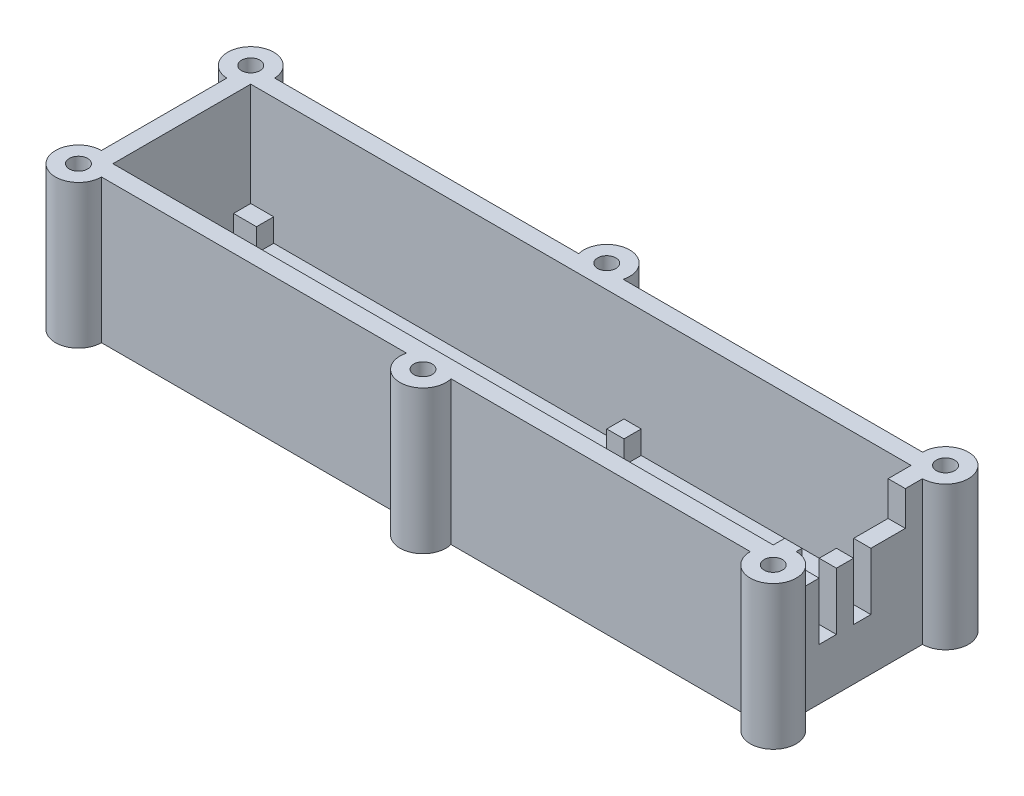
ISO-10303-21;
HEADER;
FILE_DESCRIPTION(('STEP AP214'),'2;1');
FILE_NAME('part.step','',(''),(''),'','','');
FILE_SCHEMA(('AUTOMOTIVE_DESIGN { 1 0 10303 214 1 1 1 1 }'));
ENDSEC;
DATA;
#1=APPLICATION_CONTEXT('core data for automotive mechanical design processes');
#2=APPLICATION_PROTOCOL_DEFINITION('international standard','automotive_design',2000,#1);
#3=PRODUCT_CONTEXT('',#1,'mechanical');
#4=PRODUCT('Part','Part','',(#3));
#5=PRODUCT_RELATED_PRODUCT_CATEGORY('part','',(#4));
#6=PRODUCT_DEFINITION_FORMATION('','',#4);
#7=PRODUCT_DEFINITION_CONTEXT('part definition',#1,'design');
#8=PRODUCT_DEFINITION('design','',#6,#7);
#9=PRODUCT_DEFINITION_SHAPE('','',#8);
#10=(LENGTH_UNIT() NAMED_UNIT(*) SI_UNIT(.MILLI.,.METRE.));
#11=(NAMED_UNIT(*) PLANE_ANGLE_UNIT() SI_UNIT($,.RADIAN.));
#12=(NAMED_UNIT(*) SI_UNIT($,.STERADIAN.) SOLID_ANGLE_UNIT());
#13=UNCERTAINTY_MEASURE_WITH_UNIT(LENGTH_MEASURE(1.E-05),#10,'distance_accuracy_value','');
#14=(GEOMETRIC_REPRESENTATION_CONTEXT(3) GLOBAL_UNCERTAINTY_ASSIGNED_CONTEXT((#13)) GLOBAL_UNIT_ASSIGNED_CONTEXT((#10,
#11,#12)) REPRESENTATION_CONTEXT('',''));
#15=CARTESIAN_POINT('',(0.,0.,0.));
#16=DIRECTION('',(0.,0.,1.));
#17=DIRECTION('',(1.,0.,0.));
#18=AXIS2_PLACEMENT_3D('',#15,#16,#17);
#19=CARTESIAN_POINT('',(0.,0.,0.));
#20=DIRECTION('',(0.,1.,0.));
#21=DIRECTION('',(0.,0.,1.));
#22=AXIS2_PLACEMENT_3D('',#19,#20,#21);
#23=CYLINDRICAL_SURFACE('',#22,1.6);
#24=CARTESIAN_POINT('',(0.,25.,0.));
#25=DIRECTION('',(0.,1.,0.));
#26=DIRECTION('',(0.,0.,1.));
#27=AXIS2_PLACEMENT_3D('',#24,#25,#26);
#28=CIRCLE('',#27,1.6);
#29=CARTESIAN_POINT('',(0.,25.,1.6));
#30=VERTEX_POINT('',#29);
#31=EDGE_CURVE('E875',#30,#30,#28,.T.);
#32=ORIENTED_EDGE('',*,*,#31,.T.);
#33=EDGE_LOOP('',(#32));
#34=FACE_BOUND('',#33,.T.);
#35=CARTESIAN_POINT('',(0.,3.,0.));
#36=DIRECTION('',(0.,-1.,0.));
#37=DIRECTION('',(0.,0.,-1.));
#38=AXIS2_PLACEMENT_3D('',#35,#36,#37);
#39=CIRCLE('',#38,1.6);
#40=CARTESIAN_POINT('',(0.,3.,-1.6));
#41=VERTEX_POINT('',#40);
#42=EDGE_CURVE('E664',#41,#41,#39,.F.);
#43=ORIENTED_EDGE('',*,*,#42,.F.);
#44=EDGE_LOOP('',(#43));
#45=FACE_BOUND('',#44,.T.);
#46=ADVANCED_FACE('F35',(#34,#45),#23,.F.);
#47=CARTESIAN_POINT('',(61.,0.,-31.));
#48=DIRECTION('',(0.,1.,0.));
#49=DIRECTION('',(0.,0.,1.));
#50=AXIS2_PLACEMENT_3D('',#47,#48,#49);
#51=CYLINDRICAL_SURFACE('',#50,1.60000000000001);
#52=CARTESIAN_POINT('',(61.,25.,-31.));
#53=DIRECTION('',(0.,1.,0.));
#54=DIRECTION('',(0.,0.,1.));
#55=AXIS2_PLACEMENT_3D('',#52,#53,#54);
#56=CIRCLE('',#55,1.60000000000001);
#57=CARTESIAN_POINT('',(61.,25.,-29.4));
#58=VERTEX_POINT('',#57);
#59=EDGE_CURVE('E897',#58,#58,#56,.T.);
#60=ORIENTED_EDGE('',*,*,#59,.T.);
#61=EDGE_LOOP('',(#60));
#62=FACE_BOUND('',#61,.T.);
#63=CARTESIAN_POINT('',(61.,3.,-31.));
#64=DIRECTION('',(0.,-1.,0.));
#65=DIRECTION('',(0.,0.,-1.));
#66=AXIS2_PLACEMENT_3D('',#63,#64,#65);
#67=CIRCLE('',#66,1.60000000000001);
#68=CARTESIAN_POINT('',(61.,3.,-32.6));
#69=VERTEX_POINT('',#68);
#70=EDGE_CURVE('E699',#69,#69,#67,.F.);
#71=ORIENTED_EDGE('',*,*,#70,.F.);
#72=EDGE_LOOP('',(#71));
#73=FACE_BOUND('',#72,.T.);
#74=ADVANCED_FACE('F1237',(#62,#73),#51,.F.);
#75=CARTESIAN_POINT('',(121.,0.,-30.));
#76=DIRECTION('',(0.,1.,0.));
#77=DIRECTION('',(0.,0.,1.));
#78=AXIS2_PLACEMENT_3D('',#75,#76,#77);
#79=CYLINDRICAL_SURFACE('',#78,1.6);
#80=CARTESIAN_POINT('',(121.,25.,-30.));
#81=DIRECTION('',(0.,1.,0.));
#82=DIRECTION('',(0.,0.,1.));
#83=AXIS2_PLACEMENT_3D('',#80,#81,#82);
#84=CIRCLE('',#83,1.6);
#85=CARTESIAN_POINT('',(121.,25.,-28.4));
#86=VERTEX_POINT('',#85);
#87=EDGE_CURVE('E894',#86,#86,#84,.T.);
#88=ORIENTED_EDGE('',*,*,#87,.T.);
#89=EDGE_LOOP('',(#88));
#90=FACE_BOUND('',#89,.T.);
#91=CARTESIAN_POINT('',(121.,3.,-30.));
#92=DIRECTION('',(0.,-1.,0.));
#93=DIRECTION('',(0.,0.,-1.));
#94=AXIS2_PLACEMENT_3D('',#91,#92,#93);
#95=CIRCLE('',#94,1.6);
#96=CARTESIAN_POINT('',(121.,3.,-31.6));
#97=VERTEX_POINT('',#96);
#98=EDGE_CURVE('E750',#97,#97,#95,.F.);
#99=ORIENTED_EDGE('',*,*,#98,.F.);
#100=EDGE_LOOP('',(#99));
#101=FACE_BOUND('',#100,.T.);
#102=ADVANCED_FACE('F1243',(#90,#101),#79,.F.);
#103=CARTESIAN_POINT('',(121.,0.,0.));
#104=DIRECTION('',(0.,1.,0.));
#105=DIRECTION('',(0.,0.,1.));
#106=AXIS2_PLACEMENT_3D('',#103,#104,#105);
#107=CYLINDRICAL_SURFACE('',#106,1.60000000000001);
#108=CARTESIAN_POINT('',(121.,25.,0.));
#109=DIRECTION('',(0.,1.,0.));
#110=DIRECTION('',(0.,0.,1.));
#111=AXIS2_PLACEMENT_3D('',#108,#109,#110);
#112=CIRCLE('',#111,1.60000000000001);
#113=CARTESIAN_POINT('',(121.,25.,1.60000000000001));
#114=VERTEX_POINT('',#113);
#115=EDGE_CURVE('E891',#114,#114,#112,.T.);
#116=ORIENTED_EDGE('',*,*,#115,.T.);
#117=EDGE_LOOP('',(#116));
#118=FACE_BOUND('',#117,.T.);
#119=CARTESIAN_POINT('',(121.,3.,0.));
#120=DIRECTION('',(0.,-1.,0.));
#121=DIRECTION('',(0.,0.,-1.));
#122=AXIS2_PLACEMENT_3D('',#119,#120,#121);
#123=CIRCLE('',#122,1.60000000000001);
#124=CARTESIAN_POINT('',(121.,3.,-1.60000000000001));
#125=VERTEX_POINT('',#124);
#126=EDGE_CURVE('E801',#125,#125,#123,.F.);
#127=ORIENTED_EDGE('',*,*,#126,.F.);
#128=EDGE_LOOP('',(#127));
#129=FACE_BOUND('',#128,.T.);
#130=ADVANCED_FACE('F1254',(#118,#129),#107,.F.);
#131=CARTESIAN_POINT('',(61.,0.,1.));
#132=DIRECTION('',(0.,1.,0.));
#133=DIRECTION('',(0.,0.,1.));
#134=AXIS2_PLACEMENT_3D('',#131,#132,#133);
#135=CYLINDRICAL_SURFACE('',#134,1.60000000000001);
#136=CARTESIAN_POINT('',(61.,25.,1.));
#137=DIRECTION('',(0.,1.,0.));
#138=DIRECTION('',(0.,0.,1.));
#139=AXIS2_PLACEMENT_3D('',#136,#137,#138);
#140=CIRCLE('',#139,1.60000000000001);
#141=CARTESIAN_POINT('',(61.,25.,2.6));
#142=VERTEX_POINT('',#141);
#143=EDGE_CURVE('E888',#142,#142,#140,.T.);
#144=ORIENTED_EDGE('',*,*,#143,.T.);
#145=EDGE_LOOP('',(#144));
#146=FACE_BOUND('',#145,.T.);
#147=CARTESIAN_POINT('',(61.,3.,1.));
#148=DIRECTION('',(0.,-1.,0.));
#149=DIRECTION('',(0.,0.,-1.));
#150=AXIS2_PLACEMENT_3D('',#147,#148,#149);
#151=CIRCLE('',#150,1.60000000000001);
#152=CARTESIAN_POINT('',(61.,3.,-0.600000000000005));
#153=VERTEX_POINT('',#152);
#154=EDGE_CURVE('E835',#153,#153,#151,.F.);
#155=ORIENTED_EDGE('',*,*,#154,.F.);
#156=EDGE_LOOP('',(#155));
#157=FACE_BOUND('',#156,.T.);
#158=ADVANCED_FACE('F1250',(#146,#157),#135,.F.);
#159=CARTESIAN_POINT('',(0.,25.,-30.));
#160=DIRECTION('',(0.,0.,1.));
#161=DIRECTION('',(1.,0.,0.));
#162=AXIS2_PLACEMENT_3D('',#159,#160,#161);
#163=PLANE('',#162);
#164=DIRECTION('',(-1.,0.,0.));
#165=VECTOR('',#164,1.);
#166=CARTESIAN_POINT('',(0.,0.,-30.));
#167=LINE('',#166,#165);
#168=CARTESIAN_POINT('',(117.,0.,-30.));
#169=VERTEX_POINT('',#168);
#170=CARTESIAN_POINT('',(64.8729833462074,0.,-30.));
#171=VERTEX_POINT('',#170);
#172=EDGE_CURVE('E1211',#169,#171,#167,.T.);
#173=ORIENTED_EDGE('',*,*,#172,.T.);
#174=DIRECTION('',(0.,1.,0.));
#175=VECTOR('',#174,1.);
#176=CARTESIAN_POINT('',(64.8729833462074,-11.3137084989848,-30.));
#177=LINE('',#176,#175);
#178=CARTESIAN_POINT('',(64.8729833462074,25.,-30.));
#179=VERTEX_POINT('',#178);
#180=EDGE_CURVE('E909',#171,#179,#177,.T.);
#181=ORIENTED_EDGE('',*,*,#180,.T.);
#182=DIRECTION('',(-1.,0.,0.));
#183=VECTOR('',#182,1.);
#184=CARTESIAN_POINT('',(0.,25.,-30.));
#185=LINE('',#184,#183);
#186=CARTESIAN_POINT('',(117.,25.,-30.));
#187=VERTEX_POINT('',#186);
#188=EDGE_CURVE('E43',#187,#179,#185,.T.);
#189=ORIENTED_EDGE('',*,*,#188,.F.);
#190=DIRECTION('',(0.,1.,0.));
#191=VECTOR('',#190,1.);
#192=CARTESIAN_POINT('',(117.,-11.3137084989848,-30.));
#193=LINE('',#192,#191);
#194=EDGE_CURVE('E917',#187,#169,#193,.F.);
#195=ORIENTED_EDGE('',*,*,#194,.T.);
#196=EDGE_LOOP('',(#173,#181,#189,#195));
#197=FACE_BOUND('',#196,.T.);
#198=ADVANCED_FACE('F1253',(#197),#163,.F.);
#199=CARTESIAN_POINT('',(0.,25.,0.));
#200=DIRECTION('',(0.,0.,-1.));
#201=DIRECTION('',(-1.,0.,0.));
#202=AXIS2_PLACEMENT_3D('',#199,#200,#201);
#203=PLANE('',#202);
#204=DIRECTION('',(1.,0.,0.));
#205=VECTOR('',#204,1.);
#206=CARTESIAN_POINT('',(0.,0.,0.));
#207=LINE('',#206,#205);
#208=CARTESIAN_POINT('',(4.,0.,0.));
#209=VERTEX_POINT('',#208);
#210=CARTESIAN_POINT('',(57.1270166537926,0.,0.));
#211=VERTEX_POINT('',#210);
#212=EDGE_CURVE('E1224',#209,#211,#207,.T.);
#213=ORIENTED_EDGE('',*,*,#212,.T.);
#214=DIRECTION('',(0.,1.,0.));
#215=VECTOR('',#214,1.);
#216=CARTESIAN_POINT('',(57.1270166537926,-11.3137084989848,0.));
#217=LINE('',#216,#215);
#218=CARTESIAN_POINT('',(57.1270166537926,25.,0.));
#219=VERTEX_POINT('',#218);
#220=EDGE_CURVE('E943',#211,#219,#217,.T.);
#221=ORIENTED_EDGE('',*,*,#220,.T.);
#222=DIRECTION('',(1.,0.,0.));
#223=VECTOR('',#222,1.);
#224=CARTESIAN_POINT('',(0.,25.,0.));
#225=LINE('',#224,#223);
#226=CARTESIAN_POINT('',(4.,25.,0.));
#227=VERTEX_POINT('',#226);
#228=EDGE_CURVE('E1212',#227,#219,#225,.T.);
#229=ORIENTED_EDGE('',*,*,#228,.F.);
#230=DIRECTION('',(0.,1.,0.));
#231=VECTOR('',#230,1.);
#232=CARTESIAN_POINT('',(4.,-11.3137084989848,0.));
#233=LINE('',#232,#231);
#234=EDGE_CURVE('E951',#227,#209,#233,.F.);
#235=ORIENTED_EDGE('',*,*,#234,.T.);
#236=EDGE_LOOP('',(#213,#221,#229,#235));
#237=FACE_BOUND('',#236,.T.);
#238=ADVANCED_FACE('F1404',(#237),#203,.F.);
#239=CARTESIAN_POINT('',(0.,3.,0.));
#240=DIRECTION('',(0.,1.,0.));
#241=DIRECTION('',(0.,0.,1.));
#242=AXIS2_PLACEMENT_3D('',#239,#240,#241);
#243=PLANE('',#242);
#244=DIRECTION('',(0.,0.,1.));
#245=VECTOR('',#244,1.);
#246=CARTESIAN_POINT('',(116.,3.,-3.));
#247=LINE('',#246,#245);
#248=CARTESIAN_POINT('',(116.,3.,-5.));
#249=VERTEX_POINT('',#248);
#250=CARTESIAN_POINT('',(116.,3.,-3.));
#251=VERTEX_POINT('',#250);
#252=EDGE_CURVE('E961',#249,#251,#247,.T.);
#253=ORIENTED_EDGE('',*,*,#252,.F.);
#254=DIRECTION('',(-1.,0.,0.));
#255=VECTOR('',#254,1.);
#256=CARTESIAN_POINT('',(118.,3.,-5.));
#257=LINE('',#256,#255);
#258=CARTESIAN_POINT('',(118.,3.,-5.));
#259=VERTEX_POINT('',#258);
#260=EDGE_CURVE('E956',#259,#249,#257,.T.);
#261=ORIENTED_EDGE('',*,*,#260,.F.);
#262=DIRECTION('',(0.,0.,1.));
#263=VECTOR('',#262,1.);
#264=CARTESIAN_POINT('',(118.,3.,-27.));
#265=LINE('',#264,#263);
#266=CARTESIAN_POINT('',(118.,3.,-25.));
#267=VERTEX_POINT('',#266);
#268=EDGE_CURVE('E1181',#267,#259,#265,.T.);
#269=ORIENTED_EDGE('',*,*,#268,.F.);
#270=DIRECTION('',(1.,0.,0.));
#271=VECTOR('',#270,1.);
#272=CARTESIAN_POINT('',(118.,3.,-25.));
#273=LINE('',#272,#271);
#274=CARTESIAN_POINT('',(116.,3.,-25.));
#275=VERTEX_POINT('',#274);
#276=EDGE_CURVE('E1036',#275,#267,#273,.T.);
#277=ORIENTED_EDGE('',*,*,#276,.F.);
#278=DIRECTION('',(0.,0.,1.));
#279=VECTOR('',#278,1.);
#280=CARTESIAN_POINT('',(116.,3.,-27.));
#281=LINE('',#280,#279);
#282=CARTESIAN_POINT('',(116.,3.,-27.));
#283=VERTEX_POINT('',#282);
#284=EDGE_CURVE('E1032',#283,#275,#281,.T.);
#285=ORIENTED_EDGE('',*,*,#284,.F.);
#286=DIRECTION('',(1.,0.,0.));
#287=VECTOR('',#286,1.);
#288=CARTESIAN_POINT('',(3.,3.,-27.));
#289=LINE('',#288,#287);
#290=CARTESIAN_POINT('',(71.,3.,-27.));
#291=VERTEX_POINT('',#290);
#292=EDGE_CURVE('E1184',#291,#283,#289,.T.);
#293=ORIENTED_EDGE('',*,*,#292,.F.);
#294=DIRECTION('',(0.,0.,-1.));
#295=VECTOR('',#294,1.);
#296=CARTESIAN_POINT('',(71.,3.,-27.));
#297=LINE('',#296,#295);
#298=CARTESIAN_POINT('',(71.,3.,-24.));
#299=VERTEX_POINT('',#298);
#300=EDGE_CURVE('E1089',#299,#291,#297,.T.);
#301=ORIENTED_EDGE('',*,*,#300,.F.);
#302=DIRECTION('',(1.,0.,0.));
#303=VECTOR('',#302,1.);
#304=CARTESIAN_POINT('',(68.,3.,-24.));
#305=LINE('',#304,#303);
#306=CARTESIAN_POINT('',(68.,3.,-24.));
#307=VERTEX_POINT('',#306);
#308=EDGE_CURVE('E1098',#307,#299,#305,.T.);
#309=ORIENTED_EDGE('',*,*,#308,.F.);
#310=DIRECTION('',(0.,0.,1.));
#311=VECTOR('',#310,1.);
#312=CARTESIAN_POINT('',(68.,3.,-27.));
#313=LINE('',#312,#311);
#314=CARTESIAN_POINT('',(68.,3.,-27.));
#315=VERTEX_POINT('',#314);
#316=EDGE_CURVE('E1084',#315,#307,#313,.T.);
#317=ORIENTED_EDGE('',*,*,#316,.F.);
#318=CARTESIAN_POINT('',(7.,3.,-27.));
#319=VERTEX_POINT('',#318);
#320=EDGE_CURVE('E1185',#319,#315,#289,.T.);
#321=ORIENTED_EDGE('',*,*,#320,.F.);
#322=DIRECTION('',(0.,0.,-1.));
#323=VECTOR('',#322,1.);
#324=CARTESIAN_POINT('',(7.,3.,-27.));
#325=LINE('',#324,#323);
#326=CARTESIAN_POINT('',(7.,3.,-24.));
#327=VERTEX_POINT('',#326);
#328=EDGE_CURVE('E986',#327,#319,#325,.T.);
#329=ORIENTED_EDGE('',*,*,#328,.F.);
#330=DIRECTION('',(1.,0.,0.));
#331=VECTOR('',#330,1.);
#332=CARTESIAN_POINT('',(3.,3.,-24.));
#333=LINE('',#332,#331);
#334=CARTESIAN_POINT('',(3.,3.,-24.));
#335=VERTEX_POINT('',#334);
#336=EDGE_CURVE('E981',#335,#327,#333,.T.);
#337=ORIENTED_EDGE('',*,*,#336,.F.);
#338=DIRECTION('',(0.,0.,1.));
#339=VECTOR('',#338,1.);
#340=CARTESIAN_POINT('',(3.,3.,-27.));
#341=LINE('',#340,#339);
#342=CARTESIAN_POINT('',(3.,3.,-6.));
#343=VERTEX_POINT('',#342);
#344=EDGE_CURVE('E1175',#335,#343,#341,.T.);
#345=ORIENTED_EDGE('',*,*,#344,.T.);
#346=DIRECTION('',(-1.,0.,0.));
#347=VECTOR('',#346,1.);
#348=CARTESIAN_POINT('',(3.,3.,-6.));
#349=LINE('',#348,#347);
#350=CARTESIAN_POINT('',(7.,3.,-6.));
#351=VERTEX_POINT('',#350);
#352=EDGE_CURVE('E1011',#351,#343,#349,.T.);
#353=ORIENTED_EDGE('',*,*,#352,.F.);
#354=DIRECTION('',(0.,0.,-1.));
#355=VECTOR('',#354,1.);
#356=CARTESIAN_POINT('',(7.,3.,-3.));
#357=LINE('',#356,#355);
#358=CARTESIAN_POINT('',(7.,3.,-3.));
#359=VERTEX_POINT('',#358);
#360=EDGE_CURVE('E1006',#359,#351,#357,.T.);
#361=ORIENTED_EDGE('',*,*,#360,.F.);
#362=DIRECTION('',(1.,0.,0.));
#363=VECTOR('',#362,1.);
#364=CARTESIAN_POINT('',(3.,3.,-3.));
#365=LINE('',#364,#363);
#366=CARTESIAN_POINT('',(68.,3.,-3.));
#367=VERTEX_POINT('',#366);
#368=EDGE_CURVE('E1179',#359,#367,#365,.T.);
#369=ORIENTED_EDGE('',*,*,#368,.T.);
#370=DIRECTION('',(0.,0.,1.));
#371=VECTOR('',#370,1.);
#372=CARTESIAN_POINT('',(68.,3.,-3.));
#373=LINE('',#372,#371);
#374=CARTESIAN_POINT('',(68.,3.,-6.));
#375=VERTEX_POINT('',#374);
#376=EDGE_CURVE('E1053',#375,#367,#373,.T.);
#377=ORIENTED_EDGE('',*,*,#376,.F.);
#378=DIRECTION('',(-1.,0.,0.));
#379=VECTOR('',#378,1.);
#380=CARTESIAN_POINT('',(68.,3.,-6.));
#381=LINE('',#380,#379);
#382=CARTESIAN_POINT('',(71.,3.,-6.));
#383=VERTEX_POINT('',#382);
#384=EDGE_CURVE('E1058',#383,#375,#381,.T.);
#385=ORIENTED_EDGE('',*,*,#384,.F.);
#386=DIRECTION('',(0.,0.,-1.));
#387=VECTOR('',#386,1.);
#388=CARTESIAN_POINT('',(71.,3.,-3.));
#389=LINE('',#388,#387);
#390=CARTESIAN_POINT('',(71.,3.,-3.));
#391=VERTEX_POINT('',#390);
#392=EDGE_CURVE('E1068',#391,#383,#389,.T.);
#393=ORIENTED_EDGE('',*,*,#392,.F.);
#394=EDGE_CURVE('E1177',#391,#251,#365,.T.);
#395=ORIENTED_EDGE('',*,*,#394,.T.);
#396=EDGE_LOOP('',(#253,#261,#269,#277,#285,#293,#301,#309,#317,#321,#329,#337,#345,#353,#361,
#369,#377,#385,#393,#395));
#397=FACE_BOUND('',#396,.T.);
#398=ADVANCED_FACE('F1400',(#397),#243,.T.);
#399=CARTESIAN_POINT('',(3.,3.,-3.));
#400=DIRECTION('',(0.,0.,1.));
#401=DIRECTION('',(1.,0.,0.));
#402=AXIS2_PLACEMENT_3D('',#399,#400,#401);
#403=PLANE('',#402);
#404=DIRECTION('',(0.,-1.,0.));
#405=VECTOR('',#404,1.);
#406=CARTESIAN_POINT('',(68.,7.,-3.));
#407=LINE('',#406,#405);
#408=CARTESIAN_POINT('',(68.,7.,-3.));
#409=VERTEX_POINT('',#408);
#410=EDGE_CURVE('E1081',#409,#367,#407,.T.);
#411=ORIENTED_EDGE('',*,*,#410,.T.);
#412=ORIENTED_EDGE('',*,*,#368,.F.);
#413=DIRECTION('',(0.,-1.,0.));
#414=VECTOR('',#413,1.);
#415=CARTESIAN_POINT('',(7.,7.,-3.));
#416=LINE('',#415,#414);
#417=CARTESIAN_POINT('',(7.,7.,-3.));
#418=VERTEX_POINT('',#417);
#419=EDGE_CURVE('E1029',#418,#359,#416,.T.);
#420=ORIENTED_EDGE('',*,*,#419,.F.);
#421=DIRECTION('',(1.,0.,0.));
#422=VECTOR('',#421,1.);
#423=CARTESIAN_POINT('',(3.,7.,-3.));
#424=LINE('',#423,#422);
#425=CARTESIAN_POINT('',(3.,7.,-3.));
#426=VERTEX_POINT('',#425);
#427=EDGE_CURVE('E1010',#426,#418,#424,.T.);
#428=ORIENTED_EDGE('',*,*,#427,.F.);
#429=DIRECTION('',(0.,1.,0.));
#430=VECTOR('',#429,1.);
#431=CARTESIAN_POINT('',(3.,3.,-3.));
#432=LINE('',#431,#430);
#433=CARTESIAN_POINT('',(3.,25.,-3.));
#434=VERTEX_POINT('',#433);
#435=EDGE_CURVE('E1187',#426,#434,#432,.T.);
#436=ORIENTED_EDGE('',*,*,#435,.T.);
#437=DIRECTION('',(1.,0.,0.));
#438=VECTOR('',#437,1.);
#439=CARTESIAN_POINT('',(3.,25.,-3.));
#440=LINE('',#439,#438);
#441=CARTESIAN_POINT('',(118.,25.,-3.));
#442=VERTEX_POINT('',#441);
#443=EDGE_CURVE('E1190',#434,#442,#440,.T.);
#444=ORIENTED_EDGE('',*,*,#443,.T.);
#445=DIRECTION('',(0.,1.,0.));
#446=VECTOR('',#445,1.);
#447=CARTESIAN_POINT('',(118.,3.,-3.));
#448=LINE('',#447,#446);
#449=CARTESIAN_POINT('',(118.,7.,-3.));
#450=VERTEX_POINT('',#449);
#451=EDGE_CURVE('E1203',#450,#442,#448,.T.);
#452=ORIENTED_EDGE('',*,*,#451,.F.);
#453=DIRECTION('',(1.,0.,0.));
#454=VECTOR('',#453,1.);
#455=CARTESIAN_POINT('',(118.,7.,-3.));
#456=LINE('',#455,#454);
#457=CARTESIAN_POINT('',(116.,7.,-3.));
#458=VERTEX_POINT('',#457);
#459=EDGE_CURVE('E966',#458,#450,#456,.T.);
#460=ORIENTED_EDGE('',*,*,#459,.F.);
#461=DIRECTION('',(0.,-1.,0.));
#462=VECTOR('',#461,1.);
#463=CARTESIAN_POINT('',(116.,7.,-3.));
#464=LINE('',#463,#462);
#465=EDGE_CURVE('E969',#458,#251,#464,.T.);
#466=ORIENTED_EDGE('',*,*,#465,.T.);
#467=ORIENTED_EDGE('',*,*,#394,.F.);
#468=DIRECTION('',(0.,-1.,0.));
#469=VECTOR('',#468,1.);
#470=CARTESIAN_POINT('',(71.,7.,-3.));
#471=LINE('',#470,#469);
#472=CARTESIAN_POINT('',(71.,7.,-3.));
#473=VERTEX_POINT('',#472);
#474=EDGE_CURVE('E1078',#473,#391,#471,.T.);
#475=ORIENTED_EDGE('',*,*,#474,.F.);
#476=DIRECTION('',(1.,0.,0.));
#477=VECTOR('',#476,1.);
#478=CARTESIAN_POINT('',(68.,7.,-3.));
#479=LINE('',#478,#477);
#480=EDGE_CURVE('E1057',#409,#473,#479,.T.);
#481=ORIENTED_EDGE('',*,*,#480,.F.);
#482=EDGE_LOOP('',(#411,#412,#420,#428,#436,#444,#452,#460,#466,#467,#475,#481));
#483=FACE_BOUND('',#482,.T.);
#484=ADVANCED_FACE('F1403',(#483),#403,.F.);
#485=CARTESIAN_POINT('',(118.,3.,-27.));
#486=DIRECTION('',(-1.,0.,0.));
#487=DIRECTION('',(0.,0.,1.));
#488=AXIS2_PLACEMENT_3D('',#485,#486,#487);
#489=PLANE('',#488);
#490=DIRECTION('',(0.,0.,-1.));
#491=VECTOR('',#490,1.);
#492=CARTESIAN_POINT('',(118.,19.,-5.));
#493=LINE('',#492,#491);
#494=CARTESIAN_POINT('',(118.,19.,-11.));
#495=VERTEX_POINT('',#494);
#496=CARTESIAN_POINT('',(118.,19.,-14.));
#497=VERTEX_POINT('',#496);
#498=EDGE_CURVE('E576',#495,#497,#493,.T.);
#499=ORIENTED_EDGE('',*,*,#498,.T.);
#500=DIRECTION('',(0.,-1.,0.));
#501=VECTOR('',#500,1.);
#502=CARTESIAN_POINT('',(118.,0.,-14.));
#503=LINE('',#502,#501);
#504=CARTESIAN_POINT('',(118.,9.,-14.));
#505=VERTEX_POINT('',#504);
#506=EDGE_CURVE('E617',#497,#505,#503,.T.);
#507=ORIENTED_EDGE('',*,*,#506,.T.);
#508=DIRECTION('',(0.,0.,-1.));
#509=VECTOR('',#508,1.);
#510=CARTESIAN_POINT('',(118.,9.,0.));
#511=LINE('',#510,#509);
#512=CARTESIAN_POINT('',(118.,9.,-17.));
#513=VERTEX_POINT('',#512);
#514=EDGE_CURVE('E625',#505,#513,#511,.T.);
#515=ORIENTED_EDGE('',*,*,#514,.T.);
#516=DIRECTION('',(0.,-1.,0.));
#517=VECTOR('',#516,1.);
#518=CARTESIAN_POINT('',(118.,0.,-17.));
#519=LINE('',#518,#517);
#520=CARTESIAN_POINT('',(118.,19.,-17.));
#521=VERTEX_POINT('',#520);
#522=EDGE_CURVE('E575',#521,#513,#519,.T.);
#523=ORIENTED_EDGE('',*,*,#522,.F.);
#524=CARTESIAN_POINT('',(118.,19.,-23.));
#525=VERTEX_POINT('',#524);
#526=EDGE_CURVE('E50',#521,#525,#493,.T.);
#527=ORIENTED_EDGE('',*,*,#526,.T.);
#528=DIRECTION('',(0.,1.,0.));
#529=VECTOR('',#528,1.);
#530=CARTESIAN_POINT('',(118.,25.,-23.));
#531=LINE('',#530,#529);
#532=CARTESIAN_POINT('',(118.,25.,-23.));
#533=VERTEX_POINT('',#532);
#534=EDGE_CURVE('E556',#525,#533,#531,.T.);
#535=ORIENTED_EDGE('',*,*,#534,.T.);
#536=DIRECTION('',(0.,0.,1.));
#537=VECTOR('',#536,1.);
#538=CARTESIAN_POINT('',(118.,25.,-27.));
#539=LINE('',#538,#537);
#540=CARTESIAN_POINT('',(118.,25.,-27.));
#541=VERTEX_POINT('',#540);
#542=EDGE_CURVE('E1194',#541,#533,#539,.T.);
#543=ORIENTED_EDGE('',*,*,#542,.F.);
#544=DIRECTION('',(0.,1.,0.));
#545=VECTOR('',#544,1.);
#546=CARTESIAN_POINT('',(118.,3.,-27.));
#547=LINE('',#546,#545);
#548=CARTESIAN_POINT('',(118.,7.,-27.));
#549=VERTEX_POINT('',#548);
#550=EDGE_CURVE('E1200',#549,#541,#547,.T.);
#551=ORIENTED_EDGE('',*,*,#550,.F.);
#552=DIRECTION('',(0.,0.,-1.));
#553=VECTOR('',#552,1.);
#554=CARTESIAN_POINT('',(118.,7.,-27.));
#555=LINE('',#554,#553);
#556=CARTESIAN_POINT('',(118.,7.,-25.));
#557=VERTEX_POINT('',#556);
#558=EDGE_CURVE('E1033',#557,#549,#555,.T.);
#559=ORIENTED_EDGE('',*,*,#558,.F.);
#560=DIRECTION('',(0.,-1.,0.));
#561=VECTOR('',#560,1.);
#562=CARTESIAN_POINT('',(118.,7.,-25.));
#563=LINE('',#562,#561);
#564=EDGE_CURVE('E1043',#557,#267,#563,.T.);
#565=ORIENTED_EDGE('',*,*,#564,.T.);
#566=ORIENTED_EDGE('',*,*,#268,.T.);
#567=DIRECTION('',(0.,-1.,0.));
#568=VECTOR('',#567,1.);
#569=CARTESIAN_POINT('',(118.,7.,-5.));
#570=LINE('',#569,#568);
#571=CARTESIAN_POINT('',(118.,7.,-5.));
#572=VERTEX_POINT('',#571);
#573=EDGE_CURVE('E978',#572,#259,#570,.T.);
#574=ORIENTED_EDGE('',*,*,#573,.F.);
#575=DIRECTION('',(0.,0.,-1.));
#576=VECTOR('',#575,1.);
#577=CARTESIAN_POINT('',(118.,7.,-3.));
#578=LINE('',#577,#576);
#579=EDGE_CURVE('E957',#450,#572,#578,.T.);
#580=ORIENTED_EDGE('',*,*,#579,.F.);
#581=ORIENTED_EDGE('',*,*,#451,.T.);
#582=CARTESIAN_POINT('',(118.,25.,-5.));
#583=VERTEX_POINT('',#582);
#584=EDGE_CURVE('E1193',#583,#442,#539,.T.);
#585=ORIENTED_EDGE('',*,*,#584,.F.);
#586=DIRECTION('',(0.,-1.,0.));
#587=VECTOR('',#586,1.);
#588=CARTESIAN_POINT('',(118.,25.,-5.));
#589=LINE('',#588,#587);
#590=CARTESIAN_POINT('',(118.,19.,-5.));
#591=VERTEX_POINT('',#590);
#592=EDGE_CURVE('E589',#583,#591,#589,.T.);
#593=ORIENTED_EDGE('',*,*,#592,.T.);
#594=CARTESIAN_POINT('',(118.,19.,-8.));
#595=VERTEX_POINT('',#594);
#596=EDGE_CURVE('E569',#591,#595,#493,.T.);
#597=ORIENTED_EDGE('',*,*,#596,.T.);
#598=DIRECTION('',(0.,-1.,0.));
#599=VECTOR('',#598,1.);
#600=CARTESIAN_POINT('',(118.,25.,-8.));
#601=LINE('',#600,#599);
#602=CARTESIAN_POINT('',(118.,9.,-8.));
#603=VERTEX_POINT('',#602);
#604=EDGE_CURVE('E586',#595,#603,#601,.T.);
#605=ORIENTED_EDGE('',*,*,#604,.T.);
#606=DIRECTION('',(0.,0.,-1.));
#607=VECTOR('',#606,1.);
#608=CARTESIAN_POINT('',(118.,9.,-8.));
#609=LINE('',#608,#607);
#610=CARTESIAN_POINT('',(118.,9.,-11.));
#611=VERTEX_POINT('',#610);
#612=EDGE_CURVE('E603',#603,#611,#609,.T.);
#613=ORIENTED_EDGE('',*,*,#612,.T.);
#614=DIRECTION('',(0.,-1.,0.));
#615=VECTOR('',#614,1.);
#616=CARTESIAN_POINT('',(118.,25.,-11.));
#617=LINE('',#616,#615);
#618=EDGE_CURVE('E607',#495,#611,#617,.T.);
#619=ORIENTED_EDGE('',*,*,#618,.F.);
#620=EDGE_LOOP('',(#499,#507,#515,#523,#527,#535,#543,#551,#559,#565,#566,#574,#580,#581,#585,
#593,#597,#605,#613,#619));
#621=FACE_BOUND('',#620,.T.);
#622=ADVANCED_FACE('F573',(#621),#489,.T.);
#623=CARTESIAN_POINT('',(3.,3.,-27.));
#624=DIRECTION('',(-1.,0.,0.));
#625=DIRECTION('',(0.,0.,1.));
#626=AXIS2_PLACEMENT_3D('',#623,#624,#625);
#627=PLANE('',#626);
#628=DIRECTION('',(0.,-1.,0.));
#629=VECTOR('',#628,1.);
#630=CARTESIAN_POINT('',(3.,7.,-24.));
#631=LINE('',#630,#629);
#632=CARTESIAN_POINT('',(3.,7.,-24.));
#633=VERTEX_POINT('',#632);
#634=EDGE_CURVE('E1003',#633,#335,#631,.T.);
#635=ORIENTED_EDGE('',*,*,#634,.F.);
#636=DIRECTION('',(0.,0.,1.));
#637=VECTOR('',#636,1.);
#638=CARTESIAN_POINT('',(3.,7.,-27.));
#639=LINE('',#638,#637);
#640=CARTESIAN_POINT('',(3.,7.,-27.));
#641=VERTEX_POINT('',#640);
#642=EDGE_CURVE('E982',#641,#633,#639,.T.);
#643=ORIENTED_EDGE('',*,*,#642,.F.);
#644=DIRECTION('',(0.,1.,0.));
#645=VECTOR('',#644,1.);
#646=CARTESIAN_POINT('',(3.,3.,-27.));
#647=LINE('',#646,#645);
#648=CARTESIAN_POINT('',(3.,25.,-27.));
#649=VERTEX_POINT('',#648);
#650=EDGE_CURVE('E1197',#641,#649,#647,.T.);
#651=ORIENTED_EDGE('',*,*,#650,.T.);
#652=DIRECTION('',(0.,0.,1.));
#653=VECTOR('',#652,1.);
#654=CARTESIAN_POINT('',(3.,25.,-27.));
#655=LINE('',#654,#653);
#656=EDGE_CURVE('E1174',#649,#434,#655,.T.);
#657=ORIENTED_EDGE('',*,*,#656,.T.);
#658=ORIENTED_EDGE('',*,*,#435,.F.);
#659=DIRECTION('',(0.,0.,1.));
#660=VECTOR('',#659,1.);
#661=CARTESIAN_POINT('',(3.,7.,-3.));
#662=LINE('',#661,#660);
#663=CARTESIAN_POINT('',(3.,7.,-6.));
#664=VERTEX_POINT('',#663);
#665=EDGE_CURVE('E1007',#664,#426,#662,.T.);
#666=ORIENTED_EDGE('',*,*,#665,.F.);
#667=DIRECTION('',(0.,-1.,0.));
#668=VECTOR('',#667,1.);
#669=CARTESIAN_POINT('',(3.,7.,-6.));
#670=LINE('',#669,#668);
#671=EDGE_CURVE('E1019',#664,#343,#670,.T.);
#672=ORIENTED_EDGE('',*,*,#671,.T.);
#673=ORIENTED_EDGE('',*,*,#344,.F.);
#674=EDGE_LOOP('',(#635,#643,#651,#657,#658,#666,#672,#673));
#675=FACE_BOUND('',#674,.T.);
#676=ADVANCED_FACE('F1408',(#675),#627,.F.);
#677=CARTESIAN_POINT('',(3.,3.,-27.));
#678=DIRECTION('',(0.,0.,1.));
#679=DIRECTION('',(1.,0.,0.));
#680=AXIS2_PLACEMENT_3D('',#677,#678,#679);
#681=PLANE('',#680);
#682=ORIENTED_EDGE('',*,*,#550,.T.);
#683=DIRECTION('',(1.,0.,0.));
#684=VECTOR('',#683,1.);
#685=CARTESIAN_POINT('',(3.,25.,-27.));
#686=LINE('',#685,#684);
#687=EDGE_CURVE('E1178',#649,#541,#686,.T.);
#688=ORIENTED_EDGE('',*,*,#687,.F.);
#689=ORIENTED_EDGE('',*,*,#650,.F.);
#690=DIRECTION('',(-1.,0.,0.));
#691=VECTOR('',#690,1.);
#692=CARTESIAN_POINT('',(3.,7.,-27.));
#693=LINE('',#692,#691);
#694=CARTESIAN_POINT('',(7.,7.,-27.));
#695=VERTEX_POINT('',#694);
#696=EDGE_CURVE('E991',#695,#641,#693,.T.);
#697=ORIENTED_EDGE('',*,*,#696,.F.);
#698=DIRECTION('',(0.,-1.,0.));
#699=VECTOR('',#698,1.);
#700=CARTESIAN_POINT('',(7.,7.,-27.));
#701=LINE('',#700,#699);
#702=EDGE_CURVE('E994',#695,#319,#701,.T.);
#703=ORIENTED_EDGE('',*,*,#702,.T.);
#704=ORIENTED_EDGE('',*,*,#320,.T.);
#705=DIRECTION('',(0.,-1.,0.));
#706=VECTOR('',#705,1.);
#707=CARTESIAN_POINT('',(68.,7.,-27.));
#708=LINE('',#707,#706);
#709=CARTESIAN_POINT('',(68.,7.,-27.));
#710=VERTEX_POINT('',#709);
#711=EDGE_CURVE('E1095',#710,#315,#708,.T.);
#712=ORIENTED_EDGE('',*,*,#711,.F.);
#713=DIRECTION('',(-1.,0.,0.));
#714=VECTOR('',#713,1.);
#715=CARTESIAN_POINT('',(68.,7.,-27.));
#716=LINE('',#715,#714);
#717=CARTESIAN_POINT('',(71.,7.,-27.));
#718=VERTEX_POINT('',#717);
#719=EDGE_CURVE('E1093',#718,#710,#716,.T.);
#720=ORIENTED_EDGE('',*,*,#719,.F.);
#721=DIRECTION('',(0.,-1.,0.));
#722=VECTOR('',#721,1.);
#723=CARTESIAN_POINT('',(71.,7.,-27.));
#724=LINE('',#723,#722);
#725=EDGE_CURVE('E1104',#718,#291,#724,.T.);
#726=ORIENTED_EDGE('',*,*,#725,.T.);
#727=ORIENTED_EDGE('',*,*,#292,.T.);
#728=DIRECTION('',(0.,-1.,0.));
#729=VECTOR('',#728,1.);
#730=CARTESIAN_POINT('',(116.,7.,-27.));
#731=LINE('',#730,#729);
#732=CARTESIAN_POINT('',(116.,7.,-27.));
#733=VERTEX_POINT('',#732);
#734=EDGE_CURVE('E1051',#733,#283,#731,.T.);
#735=ORIENTED_EDGE('',*,*,#734,.F.);
#736=DIRECTION('',(-1.,0.,0.));
#737=VECTOR('',#736,1.);
#738=CARTESIAN_POINT('',(118.,7.,-27.));
#739=LINE('',#738,#737);
#740=EDGE_CURVE('E1035',#549,#733,#739,.T.);
#741=ORIENTED_EDGE('',*,*,#740,.F.);
#742=EDGE_LOOP('',(#682,#688,#689,#697,#703,#704,#712,#720,#726,#727,#735,#741));
#743=FACE_BOUND('',#742,.T.);
#744=ADVANCED_FACE('F1394',(#743),#681,.T.);
#745=CARTESIAN_POINT('',(0.17157287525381,0.,-29.8284271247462));
#746=DIRECTION('',(0.,1.,0.));
#747=DIRECTION('',(0.,0.,1.));
#748=AXIS2_PLACEMENT_3D('',#745,#746,#747);
#749=CYLINDRICAL_SURFACE('',#748,1.6);
#750=CARTESIAN_POINT('',(0.17157287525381,25.,-29.8284271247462));
#751=DIRECTION('',(0.,1.,0.));
#752=DIRECTION('',(0.,0.,1.));
#753=AXIS2_PLACEMENT_3D('',#750,#751,#752);
#754=CIRCLE('',#753,1.6);
#755=CARTESIAN_POINT('',(0.17157287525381,25.,-28.2284271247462));
#756=VERTEX_POINT('',#755);
#757=EDGE_CURVE('E1160',#756,#756,#754,.T.);
#758=ORIENTED_EDGE('',*,*,#757,.T.);
#759=EDGE_LOOP('',(#758));
#760=FACE_BOUND('',#759,.T.);
#761=CARTESIAN_POINT('',(0.17157287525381,3.,-29.8284271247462));
#762=DIRECTION('',(0.,-1.,0.));
#763=DIRECTION('',(0.,0.,-1.));
#764=AXIS2_PLACEMENT_3D('',#761,#762,#763);
#765=CIRCLE('',#764,1.6);
#766=CARTESIAN_POINT('',(0.17157287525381,3.,-31.4284271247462));
#767=VERTEX_POINT('',#766);
#768=EDGE_CURVE('E1149',#767,#767,#765,.F.);
#769=ORIENTED_EDGE('',*,*,#768,.F.);
#770=EDGE_LOOP('',(#769));
#771=FACE_BOUND('',#770,.T.);
#772=ADVANCED_FACE('F1391',(#760,#771),#749,.F.);
#773=CARTESIAN_POINT('',(0.,25.,-30.));
#774=DIRECTION('',(1.,0.,0.));
#775=DIRECTION('',(0.,0.,-1.));
#776=AXIS2_PLACEMENT_3D('',#773,#774,#775);
#777=PLANE('',#776);
#778=DIRECTION('',(0.,0.,1.));
#779=VECTOR('',#778,1.);
#780=CARTESIAN_POINT('',(0.,0.,-30.));
#781=LINE('',#780,#779);
#782=CARTESIAN_POINT('',(0.,0.,-25.8321084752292));
#783=VERTEX_POINT('',#782);
#784=CARTESIAN_POINT('',(0.,0.,-4.));
#785=VERTEX_POINT('',#784);
#786=EDGE_CURVE('E1199',#783,#785,#781,.T.);
#787=ORIENTED_EDGE('',*,*,#786,.T.);
#788=DIRECTION('',(0.,1.,0.));
#789=VECTOR('',#788,1.);
#790=CARTESIAN_POINT('',(0.,-11.3137084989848,-4.));
#791=LINE('',#790,#789);
#792=CARTESIAN_POINT('',(0.,25.,-4.));
#793=VERTEX_POINT('',#792);
#794=EDGE_CURVE('E954',#785,#793,#791,.T.);
#795=ORIENTED_EDGE('',*,*,#794,.T.);
#796=DIRECTION('',(0.,0.,1.));
#797=VECTOR('',#796,1.);
#798=CARTESIAN_POINT('',(0.,25.,-30.));
#799=LINE('',#798,#797);
#800=CARTESIAN_POINT('',(0.,25.,-25.8321084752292));
#801=VERTEX_POINT('',#800);
#802=EDGE_CURVE('E1207',#801,#793,#799,.T.);
#803=ORIENTED_EDGE('',*,*,#802,.F.);
#804=DIRECTION('',(0.,1.,0.));
#805=VECTOR('',#804,1.);
#806=CARTESIAN_POINT('',(0.,-11.3137084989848,-25.8321084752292));
#807=LINE('',#806,#805);
#808=EDGE_CURVE('E1172',#801,#783,#807,.F.);
#809=ORIENTED_EDGE('',*,*,#808,.T.);
#810=EDGE_LOOP('',(#787,#795,#803,#809));
#811=FACE_BOUND('',#810,.T.);
#812=ADVANCED_FACE('F37',(#811),#777,.F.);
#813=CARTESIAN_POINT('',(64.8729833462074,0.,0.));
#814=VERTEX_POINT('',#813);
#815=CARTESIAN_POINT('',(117.,0.,0.));
#816=VERTEX_POINT('',#815);
#817=EDGE_CURVE('E1223',#814,#816,#207,.T.);
#818=ORIENTED_EDGE('',*,*,#817,.T.);
#819=DIRECTION('',(0.,1.,0.));
#820=VECTOR('',#819,1.);
#821=CARTESIAN_POINT('',(117.,-11.3137084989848,0.));
#822=LINE('',#821,#820);
#823=CARTESIAN_POINT('',(117.,25.,0.));
#824=VERTEX_POINT('',#823);
#825=EDGE_CURVE('E932',#816,#824,#822,.T.);
#826=ORIENTED_EDGE('',*,*,#825,.T.);
#827=CARTESIAN_POINT('',(64.8729833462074,25.,0.));
#828=VERTEX_POINT('',#827);
#829=EDGE_CURVE('E1210',#828,#824,#225,.T.);
#830=ORIENTED_EDGE('',*,*,#829,.F.);
#831=DIRECTION('',(0.,1.,0.));
#832=VECTOR('',#831,1.);
#833=CARTESIAN_POINT('',(64.8729833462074,-11.3137084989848,0.));
#834=LINE('',#833,#832);
#835=EDGE_CURVE('E940',#828,#814,#834,.F.);
#836=ORIENTED_EDGE('',*,*,#835,.T.);
#837=EDGE_LOOP('',(#818,#826,#830,#836));
#838=FACE_BOUND('',#837,.T.);
#839=ADVANCED_FACE('F1431',(#838),#203,.F.);
#840=CARTESIAN_POINT('',(121.,25.,-30.));
#841=DIRECTION('',(-1.,0.,0.));
#842=DIRECTION('',(0.,0.,1.));
#843=AXIS2_PLACEMENT_3D('',#840,#841,#842);
#844=PLANE('',#843);
#845=DIRECTION('',(0.,-1.,0.));
#846=VECTOR('',#845,1.);
#847=CARTESIAN_POINT('',(121.,0.,-14.));
#848=LINE('',#847,#846);
#849=CARTESIAN_POINT('',(121.,19.,-14.));
#850=VERTEX_POINT('',#849);
#851=CARTESIAN_POINT('',(121.,9.,-14.));
#852=VERTEX_POINT('',#851);
#853=EDGE_CURVE('E618',#850,#852,#848,.T.);
#854=ORIENTED_EDGE('',*,*,#853,.F.);
#855=DIRECTION('',(0.,0.,-1.));
#856=VECTOR('',#855,1.);
#857=CARTESIAN_POINT('',(121.,19.,-5.));
#858=LINE('',#857,#856);
#859=CARTESIAN_POINT('',(121.,19.,-11.));
#860=VERTEX_POINT('',#859);
#861=EDGE_CURVE('E1535',#860,#850,#858,.T.);
#862=ORIENTED_EDGE('',*,*,#861,.F.);
#863=DIRECTION('',(0.,-1.,0.));
#864=VECTOR('',#863,1.);
#865=CARTESIAN_POINT('',(121.,25.,-11.));
#866=LINE('',#865,#864);
#867=CARTESIAN_POINT('',(121.,9.,-11.));
#868=VERTEX_POINT('',#867);
#869=EDGE_CURVE('E609',#860,#868,#866,.T.);
#870=ORIENTED_EDGE('',*,*,#869,.T.);
#871=DIRECTION('',(0.,0.,-1.));
#872=VECTOR('',#871,1.);
#873=CARTESIAN_POINT('',(121.,9.,-8.));
#874=LINE('',#873,#872);
#875=CARTESIAN_POINT('',(121.,9.,-8.));
#876=VERTEX_POINT('',#875);
#877=EDGE_CURVE('E598',#876,#868,#874,.T.);
#878=ORIENTED_EDGE('',*,*,#877,.F.);
#879=DIRECTION('',(0.,-1.,0.));
#880=VECTOR('',#879,1.);
#881=CARTESIAN_POINT('',(121.,25.,-8.));
#882=LINE('',#881,#880);
#883=CARTESIAN_POINT('',(121.,19.,-8.));
#884=VERTEX_POINT('',#883);
#885=EDGE_CURVE('E601',#884,#876,#882,.T.);
#886=ORIENTED_EDGE('',*,*,#885,.F.);
#887=CARTESIAN_POINT('',(121.,19.,-5.));
#888=VERTEX_POINT('',#887);
#889=EDGE_CURVE('E58',#888,#884,#858,.T.);
#890=ORIENTED_EDGE('',*,*,#889,.F.);
#891=DIRECTION('',(0.,-1.,0.));
#892=VECTOR('',#891,1.);
#893=CARTESIAN_POINT('',(121.,25.,-5.));
#894=LINE('',#893,#892);
#895=CARTESIAN_POINT('',(121.,25.,-5.));
#896=VERTEX_POINT('',#895);
#897=EDGE_CURVE('E1536',#896,#888,#894,.T.);
#898=ORIENTED_EDGE('',*,*,#897,.F.);
#899=DIRECTION('',(0.,0.,-1.));
#900=VECTOR('',#899,1.);
#901=CARTESIAN_POINT('',(121.,25.,-30.));
#902=LINE('',#901,#900);
#903=CARTESIAN_POINT('',(121.,25.,-4.00000000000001));
#904=VERTEX_POINT('',#903);
#905=EDGE_CURVE('E1216',#904,#896,#902,.T.);
#906=ORIENTED_EDGE('',*,*,#905,.F.);
#907=DIRECTION('',(0.,1.,0.));
#908=VECTOR('',#907,1.);
#909=CARTESIAN_POINT('',(121.,-11.3137084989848,-4.00000000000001));
#910=LINE('',#909,#908);
#911=CARTESIAN_POINT('',(121.,0.,-4.00000000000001));
#912=VERTEX_POINT('',#911);
#913=EDGE_CURVE('E929',#904,#912,#910,.F.);
#914=ORIENTED_EDGE('',*,*,#913,.T.);
#915=DIRECTION('',(0.,0.,-1.));
#916=VECTOR('',#915,1.);
#917=CARTESIAN_POINT('',(121.,0.,-30.));
#918=LINE('',#917,#916);
#919=CARTESIAN_POINT('',(121.,0.,-26.));
#920=VERTEX_POINT('',#919);
#921=EDGE_CURVE('E1226',#912,#920,#918,.T.);
#922=ORIENTED_EDGE('',*,*,#921,.T.);
#923=DIRECTION('',(0.,1.,0.));
#924=VECTOR('',#923,1.);
#925=CARTESIAN_POINT('',(121.,-11.3137084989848,-26.));
#926=LINE('',#925,#924);
#927=CARTESIAN_POINT('',(121.,25.,-26.));
#928=VERTEX_POINT('',#927);
#929=EDGE_CURVE('E920',#920,#928,#926,.T.);
#930=ORIENTED_EDGE('',*,*,#929,.T.);
#931=CARTESIAN_POINT('',(121.,25.,-23.));
#932=VERTEX_POINT('',#931);
#933=EDGE_CURVE('E1215',#932,#928,#902,.T.);
#934=ORIENTED_EDGE('',*,*,#933,.F.);
#935=DIRECTION('',(0.,1.,0.));
#936=VECTOR('',#935,1.);
#937=CARTESIAN_POINT('',(121.,25.,-23.));
#938=LINE('',#937,#936);
#939=CARTESIAN_POINT('',(121.,19.,-23.));
#940=VERTEX_POINT('',#939);
#941=EDGE_CURVE('E577',#940,#932,#938,.T.);
#942=ORIENTED_EDGE('',*,*,#941,.F.);
#943=CARTESIAN_POINT('',(121.,19.,-17.));
#944=VERTEX_POINT('',#943);
#945=EDGE_CURVE('E568',#944,#940,#858,.T.);
#946=ORIENTED_EDGE('',*,*,#945,.F.);
#947=DIRECTION('',(0.,-1.,0.));
#948=VECTOR('',#947,1.);
#949=CARTESIAN_POINT('',(121.,0.,-17.));
#950=LINE('',#949,#948);
#951=CARTESIAN_POINT('',(121.,9.,-17.));
#952=VERTEX_POINT('',#951);
#953=EDGE_CURVE('E620',#944,#952,#950,.T.);
#954=ORIENTED_EDGE('',*,*,#953,.T.);
#955=DIRECTION('',(0.,0.,-1.));
#956=VECTOR('',#955,1.);
#957=CARTESIAN_POINT('',(121.,9.,0.));
#958=LINE('',#957,#956);
#959=EDGE_CURVE('E614',#852,#952,#958,.T.);
#960=ORIENTED_EDGE('',*,*,#959,.F.);
#961=EDGE_LOOP('',(#854,#862,#870,#878,#886,#890,#898,#906,#914,#922,#930,#934,#942,#946,#954,#960));
#962=FACE_BOUND('',#961,.T.);
#963=ADVANCED_FACE('F1428',(#962),#844,.F.);
#964=CARTESIAN_POINT('',(57.1270166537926,25.,-30.));
#965=VERTEX_POINT('',#964);
#966=CARTESIAN_POINT('',(4.16789152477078,25.,-30.));
#967=VERTEX_POINT('',#966);
#968=EDGE_CURVE('E1219',#965,#967,#185,.T.);
#969=ORIENTED_EDGE('',*,*,#968,.F.);
#970=DIRECTION('',(0.,1.,0.));
#971=VECTOR('',#970,1.);
#972=CARTESIAN_POINT('',(57.1270166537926,-11.3137084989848,-30.));
#973=LINE('',#972,#971);
#974=CARTESIAN_POINT('',(57.1270166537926,0.,-30.));
#975=VERTEX_POINT('',#974);
#976=EDGE_CURVE('E906',#965,#975,#973,.F.);
#977=ORIENTED_EDGE('',*,*,#976,.T.);
#978=CARTESIAN_POINT('',(4.16789152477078,0.,-30.));
#979=VERTEX_POINT('',#978);
#980=EDGE_CURVE('E1228',#975,#979,#167,.T.);
#981=ORIENTED_EDGE('',*,*,#980,.T.);
#982=DIRECTION('',(0.,1.,0.));
#983=VECTOR('',#982,1.);
#984=CARTESIAN_POINT('',(4.16789152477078,-11.3137084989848,-30.));
#985=LINE('',#984,#983);
#986=EDGE_CURVE('E1169',#979,#967,#985,.T.);
#987=ORIENTED_EDGE('',*,*,#986,.T.);
#988=EDGE_LOOP('',(#969,#977,#981,#987));
#989=FACE_BOUND('',#988,.T.);
#990=ADVANCED_FACE('F1421',(#989),#163,.F.);
#991=CARTESIAN_POINT('',(0.,25.,0.));
#992=DIRECTION('',(0.,1.,0.));
#993=DIRECTION('',(0.,0.,1.));
#994=AXIS2_PLACEMENT_3D('',#991,#992,#993);
#995=PLANE('',#994);
#996=DIRECTION('',(1.,0.,0.));
#997=VECTOR('',#996,1.);
#998=CARTESIAN_POINT('',(99.0263340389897,25.,-23.));
#999=LINE('',#998,#997);
#1000=EDGE_CURVE('E561',#533,#932,#999,.T.);
#1001=ORIENTED_EDGE('',*,*,#1000,.T.);
#1002=ORIENTED_EDGE('',*,*,#933,.T.);
#1003=CARTESIAN_POINT('',(121.,25.,-30.));
#1004=DIRECTION('',(0.,1.,0.));
#1005=DIRECTION('',(0.,0.,1.));
#1006=AXIS2_PLACEMENT_3D('',#1003,#1004,#1005);
#1007=CIRCLE('',#1006,4.00000000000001);
#1008=EDGE_CURVE('E914',#928,#187,#1007,.T.);
#1009=ORIENTED_EDGE('',*,*,#1008,.T.);
#1010=ORIENTED_EDGE('',*,*,#188,.T.);
#1011=CARTESIAN_POINT('',(61.,25.,-31.));
#1012=DIRECTION('',(0.,1.,0.));
#1013=DIRECTION('',(0.,0.,1.));
#1014=AXIS2_PLACEMENT_3D('',#1011,#1012,#1013);
#1015=CIRCLE('',#1014,4.00000000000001);
#1016=EDGE_CURVE('E903',#179,#965,#1015,.T.);
#1017=ORIENTED_EDGE('',*,*,#1016,.T.);
#1018=ORIENTED_EDGE('',*,*,#968,.T.);
#1019=CARTESIAN_POINT('',(0.17157287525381,25.,-29.8284271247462));
#1020=DIRECTION('',(0.,1.,0.));
#1021=DIRECTION('',(0.,0.,1.));
#1022=AXIS2_PLACEMENT_3D('',#1019,#1020,#1021);
#1023=CIRCLE('',#1022,4.);
#1024=EDGE_CURVE('E1163',#967,#801,#1023,.T.);
#1025=ORIENTED_EDGE('',*,*,#1024,.T.);
#1026=ORIENTED_EDGE('',*,*,#802,.T.);
#1027=CARTESIAN_POINT('',(0.,25.,0.));
#1028=DIRECTION('',(0.,1.,0.));
#1029=DIRECTION('',(0.,0.,1.));
#1030=AXIS2_PLACEMENT_3D('',#1027,#1028,#1029);
#1031=CIRCLE('',#1030,4.);
#1032=EDGE_CURVE('E945',#793,#227,#1031,.T.);
#1033=ORIENTED_EDGE('',*,*,#1032,.T.);
#1034=ORIENTED_EDGE('',*,*,#228,.T.);
#1035=CARTESIAN_POINT('',(61.,25.,1.));
#1036=DIRECTION('',(0.,1.,0.));
#1037=DIRECTION('',(0.,0.,1.));
#1038=AXIS2_PLACEMENT_3D('',#1035,#1036,#1037);
#1039=CIRCLE('',#1038,4.00000000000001);
#1040=EDGE_CURVE('E937',#219,#828,#1039,.T.);
#1041=ORIENTED_EDGE('',*,*,#1040,.T.);
#1042=ORIENTED_EDGE('',*,*,#829,.T.);
#1043=CARTESIAN_POINT('',(121.,25.,0.));
#1044=DIRECTION('',(0.,1.,0.));
#1045=DIRECTION('',(0.,0.,1.));
#1046=AXIS2_PLACEMENT_3D('',#1043,#1044,#1045);
#1047=CIRCLE('',#1046,4.00000000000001);
#1048=EDGE_CURVE('E926',#824,#904,#1047,.T.);
#1049=ORIENTED_EDGE('',*,*,#1048,.T.);
#1050=ORIENTED_EDGE('',*,*,#905,.T.);
#1051=DIRECTION('',(1.,0.,0.));
#1052=VECTOR('',#1051,1.);
#1053=CARTESIAN_POINT('',(99.0263340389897,25.,-5.));
#1054=LINE('',#1053,#1052);
#1055=EDGE_CURVE('E1477',#583,#896,#1054,.T.);
#1056=ORIENTED_EDGE('',*,*,#1055,.F.);
#1057=ORIENTED_EDGE('',*,*,#584,.T.);
#1058=ORIENTED_EDGE('',*,*,#443,.F.);
#1059=ORIENTED_EDGE('',*,*,#656,.F.);
#1060=ORIENTED_EDGE('',*,*,#687,.T.);
#1061=ORIENTED_EDGE('',*,*,#542,.T.);
#1062=EDGE_LOOP('',(#1001,#1002,#1009,#1010,#1017,#1018,#1025,#1026,#1033,#1034,#1041,#1042,
#1049,#1050,#1056,#1057,#1058,#1059,#1060,#1061));
#1063=FACE_BOUND('',#1062,.T.);
#1064=ORIENTED_EDGE('',*,*,#31,.F.);
#1065=EDGE_LOOP('',(#1064));
#1066=FACE_BOUND('',#1065,.T.);
#1067=ORIENTED_EDGE('',*,*,#143,.F.);
#1068=EDGE_LOOP('',(#1067));
#1069=FACE_BOUND('',#1068,.T.);
#1070=ORIENTED_EDGE('',*,*,#115,.F.);
#1071=EDGE_LOOP('',(#1070));
#1072=FACE_BOUND('',#1071,.T.);
#1073=ORIENTED_EDGE('',*,*,#87,.F.);
#1074=EDGE_LOOP('',(#1073));
#1075=FACE_BOUND('',#1074,.T.);
#1076=ORIENTED_EDGE('',*,*,#59,.F.);
#1077=EDGE_LOOP('',(#1076));
#1078=FACE_BOUND('',#1077,.T.);
#1079=ORIENTED_EDGE('',*,*,#757,.F.);
#1080=EDGE_LOOP('',(#1079));
#1081=FACE_BOUND('',#1080,.T.);
#1082=ADVANCED_FACE('F1418',(#1063,#1066,#1069,#1072,#1075,#1078,#1081),#995,.T.);
#1083=CARTESIAN_POINT('',(0.,0.,0.));
#1084=DIRECTION('',(0.,1.,0.));
#1085=DIRECTION('',(0.,0.,1.));
#1086=AXIS2_PLACEMENT_3D('',#1083,#1084,#1085);
#1087=PLANE('',#1086);
#1088=DIRECTION('',(0.5,0.,0.866025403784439));
#1089=VECTOR('',#1088,1.);
#1090=CARTESIAN_POINT('',(1.58771324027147,0.,-2.75000000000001));
#1091=LINE('',#1090,#1089);
#1092=CARTESIAN_POINT('',(1.58771324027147,0.,-2.75000000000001));
#1093=VERTEX_POINT('',#1092);
#1094=CARTESIAN_POINT('',(3.17542648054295,0.,0.));
#1095=VERTEX_POINT('',#1094);
#1096=EDGE_CURVE('E659',#1093,#1095,#1091,.T.);
#1097=ORIENTED_EDGE('',*,*,#1096,.F.);
#1098=DIRECTION('',(1.,0.,0.));
#1099=VECTOR('',#1098,1.);
#1100=CARTESIAN_POINT('',(-1.58771324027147,0.,-2.75000000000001));
#1101=LINE('',#1100,#1099);
#1102=CARTESIAN_POINT('',(-1.58771324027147,0.,-2.75000000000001));
#1103=VERTEX_POINT('',#1102);
#1104=EDGE_CURVE('E662',#1103,#1093,#1101,.T.);
#1105=ORIENTED_EDGE('',*,*,#1104,.F.);
#1106=DIRECTION('',(0.5,0.,-0.866025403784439));
#1107=VECTOR('',#1106,1.);
#1108=CARTESIAN_POINT('',(-3.17542648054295,0.,0.));
#1109=LINE('',#1108,#1107);
#1110=CARTESIAN_POINT('',(-3.17542648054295,0.,0.));
#1111=VERTEX_POINT('',#1110);
#1112=EDGE_CURVE('E646',#1111,#1103,#1109,.T.);
#1113=ORIENTED_EDGE('',*,*,#1112,.F.);
#1114=DIRECTION('',(-0.5,0.,-0.866025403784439));
#1115=VECTOR('',#1114,1.);
#1116=CARTESIAN_POINT('',(-1.58771324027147,0.,2.75000000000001));
#1117=LINE('',#1116,#1115);
#1118=CARTESIAN_POINT('',(-1.58771324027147,0.,2.75000000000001));
#1119=VERTEX_POINT('',#1118);
#1120=EDGE_CURVE('E649',#1119,#1111,#1117,.T.);
#1121=ORIENTED_EDGE('',*,*,#1120,.F.);
#1122=DIRECTION('',(-1.,0.,0.));
#1123=VECTOR('',#1122,1.);
#1124=CARTESIAN_POINT('',(1.58771324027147,0.,2.75000000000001));
#1125=LINE('',#1124,#1123);
#1126=CARTESIAN_POINT('',(1.58771324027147,0.,2.75000000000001));
#1127=VERTEX_POINT('',#1126);
#1128=EDGE_CURVE('E653',#1127,#1119,#1125,.T.);
#1129=ORIENTED_EDGE('',*,*,#1128,.F.);
#1130=DIRECTION('',(-0.5,0.,0.866025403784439));
#1131=VECTOR('',#1130,1.);
#1132=CARTESIAN_POINT('',(3.17542648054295,0.,0.));
#1133=LINE('',#1132,#1131);
#1134=EDGE_CURVE('E656',#1095,#1127,#1133,.T.);
#1135=ORIENTED_EDGE('',*,*,#1134,.F.);
#1136=EDGE_LOOP('',(#1097,#1105,#1113,#1121,#1129,#1135));
#1137=FACE_BOUND('',#1136,.T.);
#1138=DIRECTION('',(-0.499999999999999,0.,0.866025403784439));
#1139=VECTOR('',#1138,1.);
#1140=CARTESIAN_POINT('',(34.7081761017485,0.,20.0387748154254));
#1141=LINE('',#1140,#1139);
#1142=CARTESIAN_POINT('',(64.175426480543,0.,-31.));
#1143=VERTEX_POINT('',#1142);
#1144=CARTESIAN_POINT('',(62.5877132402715,0.,-28.25));
#1145=VERTEX_POINT('',#1144);
#1146=EDGE_CURVE('E708',#1143,#1145,#1141,.T.);
#1147=ORIENTED_EDGE('',*,*,#1146,.F.);
#1148=DIRECTION('',(0.499999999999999,0.,0.866025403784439));
#1149=VECTOR('',#1148,1.);
#1150=CARTESIAN_POINT('',(61.554963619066,0.,-35.5387748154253));
#1151=LINE('',#1150,#1149);
#1152=CARTESIAN_POINT('',(62.5877132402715,0.,-33.75));
#1153=VERTEX_POINT('',#1152);
#1154=EDGE_CURVE('E711',#1153,#1143,#1151,.T.);
#1155=ORIENTED_EDGE('',*,*,#1154,.F.);
#1156=DIRECTION('',(1.,0.,0.));
#1157=VECTOR('',#1156,1.);
#1158=CARTESIAN_POINT('',(0.,0.,-33.75));
#1159=LINE('',#1158,#1157);
#1160=CARTESIAN_POINT('',(59.4122867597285,0.,-33.75));
#1161=VERTEX_POINT('',#1160);
#1162=EDGE_CURVE('E695',#1161,#1153,#1159,.T.);
#1163=ORIENTED_EDGE('',*,*,#1162,.F.);
#1164=DIRECTION('',(0.499999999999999,0.,-0.866025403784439));
#1165=VECTOR('',#1164,1.);
#1166=CARTESIAN_POINT('',(29.945036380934,0.,17.2887748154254));
#1167=LINE('',#1166,#1165);
#1168=CARTESIAN_POINT('',(57.824573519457,0.,-31.));
#1169=VERTEX_POINT('',#1168);
#1170=EDGE_CURVE('E698',#1169,#1161,#1167,.T.);
#1171=ORIENTED_EDGE('',*,*,#1170,.F.);
#1172=DIRECTION('',(-0.499999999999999,0.,-0.866025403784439));
#1173=VECTOR('',#1172,1.);
#1174=CARTESIAN_POINT('',(56.7918238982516,0.,-32.7887748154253));
#1175=LINE('',#1174,#1173);
#1176=CARTESIAN_POINT('',(59.4122867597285,0.,-28.25));
#1177=VERTEX_POINT('',#1176);
#1178=EDGE_CURVE('E702',#1177,#1169,#1175,.T.);
#1179=ORIENTED_EDGE('',*,*,#1178,.F.);
#1180=DIRECTION('',(-1.,0.,0.));
#1181=VECTOR('',#1180,1.);
#1182=CARTESIAN_POINT('',(0.,0.,-28.25));
#1183=LINE('',#1182,#1181);
#1184=EDGE_CURVE('E705',#1145,#1177,#1183,.T.);
#1185=ORIENTED_EDGE('',*,*,#1184,.F.);
#1186=EDGE_LOOP('',(#1147,#1155,#1163,#1171,#1179,#1185));
#1187=FACE_BOUND('',#1186,.T.);
#1188=DIRECTION('',(1.,0.,0.));
#1189=VECTOR('',#1188,1.);
#1190=CARTESIAN_POINT('',(0.,0.,-32.75));
#1191=LINE('',#1190,#1189);
#1192=CARTESIAN_POINT('',(119.412286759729,0.,-32.75));
#1193=VERTEX_POINT('',#1192);
#1194=CARTESIAN_POINT('',(122.587713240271,0.,-32.75));
#1195=VERTEX_POINT('',#1194);
#1196=EDGE_CURVE('E759',#1193,#1195,#1191,.T.);
#1197=ORIENTED_EDGE('',*,*,#1196,.F.);
#1198=DIRECTION('',(0.500000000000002,0.,-0.866025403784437));
#1199=VECTOR('',#1198,1.);
#1200=CARTESIAN_POINT('',(75.3780490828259,0.,43.5195369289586));
#1201=LINE('',#1200,#1199);
#1202=CARTESIAN_POINT('',(117.824573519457,0.,-30.));
#1203=VERTEX_POINT('',#1202);
#1204=EDGE_CURVE('E762',#1203,#1193,#1201,.T.);
#1205=ORIENTED_EDGE('',*,*,#1204,.F.);
#1206=DIRECTION('',(-0.500000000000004,0.,-0.866025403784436));
#1207=VECTOR('',#1206,1.);
#1208=CARTESIAN_POINT('',(101.358811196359,0.,-58.5195369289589));
#1209=LINE('',#1208,#1207);
#1210=CARTESIAN_POINT('',(119.412286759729,0.,-27.25));
#1211=VERTEX_POINT('',#1210);
#1212=EDGE_CURVE('E746',#1211,#1203,#1209,.T.);
#1213=ORIENTED_EDGE('',*,*,#1212,.F.);
#1214=DIRECTION('',(-1.,0.,0.));
#1215=VECTOR('',#1214,1.);
#1216=CARTESIAN_POINT('',(0.,0.,-27.25));
#1217=LINE('',#1216,#1215);
#1218=CARTESIAN_POINT('',(122.587713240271,0.,-27.25));
#1219=VERTEX_POINT('',#1218);
#1220=EDGE_CURVE('E749',#1219,#1211,#1217,.T.);
#1221=ORIENTED_EDGE('',*,*,#1220,.F.);
#1222=DIRECTION('',(-0.500000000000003,0.,0.866025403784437));
#1223=VECTOR('',#1222,1.);
#1224=CARTESIAN_POINT('',(80.1411888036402,0.,46.2695369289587));
#1225=LINE('',#1224,#1223);
#1226=CARTESIAN_POINT('',(124.175426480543,0.,-30.));
#1227=VERTEX_POINT('',#1226);
#1228=EDGE_CURVE('E753',#1227,#1219,#1225,.T.);
#1229=ORIENTED_EDGE('',*,*,#1228,.F.);
#1230=DIRECTION('',(0.500000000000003,0.,0.866025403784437));
#1231=VECTOR('',#1230,1.);
#1232=CARTESIAN_POINT('',(106.121950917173,0.,-61.2695369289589));
#1233=LINE('',#1232,#1231);
#1234=EDGE_CURVE('E756',#1195,#1227,#1233,.T.);
#1235=ORIENTED_EDGE('',*,*,#1234,.F.);
#1236=EDGE_LOOP('',(#1197,#1205,#1213,#1221,#1229,#1235));
#1237=FACE_BOUND('',#1236,.T.);
#1238=DIRECTION('',(1.,0.,0.));
#1239=VECTOR('',#1238,1.);
#1240=CARTESIAN_POINT('',(0.,0.,-2.75000000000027));
#1241=LINE('',#1240,#1239);
#1242=CARTESIAN_POINT('',(119.412286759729,0.,-2.75000000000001));
#1243=VERTEX_POINT('',#1242);
#1244=CARTESIAN_POINT('',(122.587713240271,0.,-2.75));
#1245=VERTEX_POINT('',#1244);
#1246=EDGE_CURVE('E810',#1243,#1245,#1241,.T.);
#1247=ORIENTED_EDGE('',*,*,#1246,.F.);
#1248=DIRECTION('',(0.5,0.,-0.866025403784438));
#1249=VECTOR('',#1248,1.);
#1250=CARTESIAN_POINT('',(88.3684301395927,0.,51.0195369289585));
#1251=LINE('',#1250,#1249);
#1252=CARTESIAN_POINT('',(117.824573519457,0.,0.));
#1253=VERTEX_POINT('',#1252);
#1254=EDGE_CURVE('E813',#1253,#1243,#1251,.T.);
#1255=ORIENTED_EDGE('',*,*,#1254,.F.);
#1256=DIRECTION('',(-0.5,0.,-0.866025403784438));
#1257=VECTOR('',#1256,1.);
#1258=CARTESIAN_POINT('',(88.3684301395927,0.,-51.0195369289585));
#1259=LINE('',#1258,#1257);
#1260=CARTESIAN_POINT('',(119.412286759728,0.,2.75));
#1261=VERTEX_POINT('',#1260);
#1262=EDGE_CURVE('E797',#1261,#1253,#1259,.T.);
#1263=ORIENTED_EDGE('',*,*,#1262,.F.);
#1264=DIRECTION('',(-1.,0.,0.));
#1265=VECTOR('',#1264,1.);
#1266=CARTESIAN_POINT('',(0.,0.,2.75));
#1267=LINE('',#1266,#1265);
#1268=CARTESIAN_POINT('',(122.587713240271,0.,2.75));
#1269=VERTEX_POINT('',#1268);
#1270=EDGE_CURVE('E800',#1269,#1261,#1267,.T.);
#1271=ORIENTED_EDGE('',*,*,#1270,.F.);
#1272=DIRECTION('',(-0.5,0.,0.866025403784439));
#1273=VECTOR('',#1272,1.);
#1274=CARTESIAN_POINT('',(93.1315698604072,0.,53.7695369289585));
#1275=LINE('',#1274,#1273);
#1276=CARTESIAN_POINT('',(124.175426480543,0.,0.));
#1277=VERTEX_POINT('',#1276);
#1278=EDGE_CURVE('E804',#1277,#1269,#1275,.T.);
#1279=ORIENTED_EDGE('',*,*,#1278,.F.);
#1280=DIRECTION('',(0.499999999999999,0.,0.86602540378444));
#1281=VECTOR('',#1280,1.);
#1282=CARTESIAN_POINT('',(93.1315698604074,0.,-53.7695369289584));
#1283=LINE('',#1282,#1281);
#1284=EDGE_CURVE('E807',#1245,#1277,#1283,.T.);
#1285=ORIENTED_EDGE('',*,*,#1284,.F.);
#1286=EDGE_LOOP('',(#1247,#1255,#1263,#1271,#1279,#1285));
#1287=FACE_BOUND('',#1286,.T.);
#1288=DIRECTION('',(1.,0.,0.));
#1289=VECTOR('',#1288,1.);
#1290=CARTESIAN_POINT('',(0.,0.,-1.74999999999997));
#1291=LINE('',#1290,#1289);
#1292=CARTESIAN_POINT('',(59.4122867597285,0.,-1.75000000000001));
#1293=VERTEX_POINT('',#1292);
#1294=CARTESIAN_POINT('',(62.5877132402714,0.,-1.75000000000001));
#1295=VERTEX_POINT('',#1294);
#1296=EDGE_CURVE('E859',#1293,#1295,#1291,.T.);
#1297=ORIENTED_EDGE('',*,*,#1296,.F.);
#1298=DIRECTION('',(0.500000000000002,0.,-0.866025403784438));
#1299=VECTOR('',#1298,1.);
#1300=CARTESIAN_POINT('',(43.8014428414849,0.,25.2887748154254));
#1301=LINE('',#1300,#1299);
#1302=CARTESIAN_POINT('',(57.824573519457,0.,0.999999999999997));
#1303=VERTEX_POINT('',#1302);
#1304=EDGE_CURVE('E815',#1303,#1293,#1301,.T.);
#1305=ORIENTED_EDGE('',*,*,#1304,.F.);
#1306=DIRECTION('',(-0.500000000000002,0.,-0.866025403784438));
#1307=VECTOR('',#1306,1.);
#1308=CARTESIAN_POINT('',(42.9354174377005,0.,-24.7887748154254));
#1309=LINE('',#1308,#1307);
#1310=CARTESIAN_POINT('',(59.4122867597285,0.,3.75));
#1311=VERTEX_POINT('',#1310);
#1312=EDGE_CURVE('E839',#1311,#1303,#1309,.T.);
#1313=ORIENTED_EDGE('',*,*,#1312,.F.);
#1314=DIRECTION('',(-1.,0.,0.));
#1315=VECTOR('',#1314,1.);
#1316=CARTESIAN_POINT('',(0.,0.,3.75));
#1317=LINE('',#1316,#1315);
#1318=CARTESIAN_POINT('',(62.5877132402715,0.,3.75000000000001));
#1319=VERTEX_POINT('',#1318);
#1320=EDGE_CURVE('E868',#1319,#1311,#1317,.T.);
#1321=ORIENTED_EDGE('',*,*,#1320,.F.);
#1322=DIRECTION('',(-0.5,0.,0.866025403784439));
#1323=VECTOR('',#1322,1.);
#1324=CARTESIAN_POINT('',(48.5645825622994,0.,28.0387748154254));
#1325=LINE('',#1324,#1323);
#1326=CARTESIAN_POINT('',(64.1754264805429,0.,0.999999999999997));
#1327=VERTEX_POINT('',#1326);
#1328=EDGE_CURVE('E865',#1327,#1319,#1325,.T.);
#1329=ORIENTED_EDGE('',*,*,#1328,.F.);
#1330=DIRECTION('',(0.500000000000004,0.,0.866025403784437));
#1331=VECTOR('',#1330,1.);
#1332=CARTESIAN_POINT('',(47.6985571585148,0.,-27.5387748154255));
#1333=LINE('',#1332,#1331);
#1334=EDGE_CURVE('E862',#1295,#1327,#1333,.T.);
#1335=ORIENTED_EDGE('',*,*,#1334,.F.);
#1336=EDGE_LOOP('',(#1297,#1305,#1313,#1321,#1329,#1335));
#1337=FACE_BOUND('',#1336,.T.);
#1338=DIRECTION('',(0.5,0.,-0.866025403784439));
#1339=VECTOR('',#1338,1.);
#1340=CARTESIAN_POINT('',(-3.00385360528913,0.,-29.8284271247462));
#1341=LINE('',#1340,#1339);
#1342=CARTESIAN_POINT('',(-3.00385360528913,0.,-29.8284271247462));
#1343=VERTEX_POINT('',#1342);
#1344=CARTESIAN_POINT('',(-1.41614036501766,0.,-32.5784271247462));
#1345=VERTEX_POINT('',#1344);
#1346=EDGE_CURVE('E1133',#1343,#1345,#1341,.T.);
#1347=ORIENTED_EDGE('',*,*,#1346,.F.);
#1348=DIRECTION('',(-0.5,0.,-0.866025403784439));
#1349=VECTOR('',#1348,1.);
#1350=CARTESIAN_POINT('',(-1.41614036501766,0.,-27.0784271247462));
#1351=LINE('',#1350,#1349);
#1352=CARTESIAN_POINT('',(-1.41614036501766,0.,-27.0784271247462));
#1353=VERTEX_POINT('',#1352);
#1354=EDGE_CURVE('E1111',#1353,#1343,#1351,.T.);
#1355=ORIENTED_EDGE('',*,*,#1354,.F.);
#1356=DIRECTION('',(-1.,0.,0.));
#1357=VECTOR('',#1356,1.);
#1358=CARTESIAN_POINT('',(1.75928611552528,0.,-27.0784271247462));
#1359=LINE('',#1358,#1357);
#1360=CARTESIAN_POINT('',(1.75928611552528,0.,-27.0784271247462));
#1361=VERTEX_POINT('',#1360);
#1362=EDGE_CURVE('E1116',#1361,#1353,#1359,.T.);
#1363=ORIENTED_EDGE('',*,*,#1362,.F.);
#1364=DIRECTION('',(-0.5,0.,0.866025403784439));
#1365=VECTOR('',#1364,1.);
#1366=CARTESIAN_POINT('',(3.34699935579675,0.,-29.8284271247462));
#1367=LINE('',#1366,#1365);
#1368=CARTESIAN_POINT('',(3.34699935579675,0.,-29.8284271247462));
#1369=VERTEX_POINT('',#1368);
#1370=EDGE_CURVE('E1142',#1369,#1361,#1367,.T.);
#1371=ORIENTED_EDGE('',*,*,#1370,.F.);
#1372=DIRECTION('',(0.5,0.,0.866025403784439));
#1373=VECTOR('',#1372,1.);
#1374=CARTESIAN_POINT('',(1.75928611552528,0.,-32.5784271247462));
#1375=LINE('',#1374,#1373);
#1376=CARTESIAN_POINT('',(1.75928611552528,0.,-32.5784271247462));
#1377=VERTEX_POINT('',#1376);
#1378=EDGE_CURVE('E1139',#1377,#1369,#1375,.T.);
#1379=ORIENTED_EDGE('',*,*,#1378,.F.);
#1380=DIRECTION('',(1.,0.,0.));
#1381=VECTOR('',#1380,1.);
#1382=CARTESIAN_POINT('',(-1.41614036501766,0.,-32.5784271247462));
#1383=LINE('',#1382,#1381);
#1384=EDGE_CURVE('E1136',#1345,#1377,#1383,.T.);
#1385=ORIENTED_EDGE('',*,*,#1384,.F.);
#1386=EDGE_LOOP('',(#1347,#1355,#1363,#1371,#1379,#1385));
#1387=FACE_BOUND('',#1386,.T.);
#1388=ORIENTED_EDGE('',*,*,#980,.F.);
#1389=CARTESIAN_POINT('',(61.,0.,-31.));
#1390=DIRECTION('',(0.,1.,0.));
#1391=DIRECTION('',(0.,0.,1.));
#1392=AXIS2_PLACEMENT_3D('',#1389,#1390,#1391);
#1393=CIRCLE('',#1392,4.00000000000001);
#1394=EDGE_CURVE('E900',#975,#171,#1393,.F.);
#1395=ORIENTED_EDGE('',*,*,#1394,.T.);
#1396=ORIENTED_EDGE('',*,*,#172,.F.);
#1397=CARTESIAN_POINT('',(121.,0.,-30.));
#1398=DIRECTION('',(0.,1.,0.));
#1399=DIRECTION('',(0.,0.,1.));
#1400=AXIS2_PLACEMENT_3D('',#1397,#1398,#1399);
#1401=CIRCLE('',#1400,4.00000000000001);
#1402=EDGE_CURVE('E911',#169,#920,#1401,.F.);
#1403=ORIENTED_EDGE('',*,*,#1402,.T.);
#1404=ORIENTED_EDGE('',*,*,#921,.F.);
#1405=CARTESIAN_POINT('',(121.,0.,0.));
#1406=DIRECTION('',(0.,1.,0.));
#1407=DIRECTION('',(0.,0.,1.));
#1408=AXIS2_PLACEMENT_3D('',#1405,#1406,#1407);
#1409=CIRCLE('',#1408,4.00000000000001);
#1410=EDGE_CURVE('E923',#912,#816,#1409,.F.);
#1411=ORIENTED_EDGE('',*,*,#1410,.T.);
#1412=ORIENTED_EDGE('',*,*,#817,.F.);
#1413=CARTESIAN_POINT('',(61.,0.,1.));
#1414=DIRECTION('',(0.,1.,0.));
#1415=DIRECTION('',(0.,0.,1.));
#1416=AXIS2_PLACEMENT_3D('',#1413,#1414,#1415);
#1417=CIRCLE('',#1416,4.00000000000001);
#1418=EDGE_CURVE('E934',#814,#211,#1417,.F.);
#1419=ORIENTED_EDGE('',*,*,#1418,.T.);
#1420=ORIENTED_EDGE('',*,*,#212,.F.);
#1421=CARTESIAN_POINT('',(0.,0.,0.));
#1422=DIRECTION('',(0.,1.,0.));
#1423=DIRECTION('',(0.,0.,1.));
#1424=AXIS2_PLACEMENT_3D('',#1421,#1422,#1423);
#1425=CIRCLE('',#1424,4.);
#1426=EDGE_CURVE('E948',#209,#785,#1425,.F.);
#1427=ORIENTED_EDGE('',*,*,#1426,.T.);
#1428=ORIENTED_EDGE('',*,*,#786,.F.);
#1429=CARTESIAN_POINT('',(0.17157287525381,0.,-29.8284271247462));
#1430=DIRECTION('',(0.,1.,0.));
#1431=DIRECTION('',(0.,0.,1.));
#1432=AXIS2_PLACEMENT_3D('',#1429,#1430,#1431);
#1433=CIRCLE('',#1432,4.);
#1434=EDGE_CURVE('E1166',#783,#979,#1433,.F.);
#1435=ORIENTED_EDGE('',*,*,#1434,.T.);
#1436=EDGE_LOOP('',(#1388,#1395,#1396,#1403,#1404,#1411,#1412,#1419,#1420,#1427,#1428,#1435));
#1437=FACE_BOUND('',#1436,.T.);
#1438=ADVANCED_FACE('F1398',(#1137,#1187,#1237,#1287,#1337,#1387,#1437),#1087,.F.);
#1439=CARTESIAN_POINT('',(0.17157287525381,-11.3137084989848,-29.8284271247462));
#1440=DIRECTION('',(0.,1.,0.));
#1441=DIRECTION('',(0.,0.,1.));
#1442=AXIS2_PLACEMENT_3D('',#1439,#1440,#1441);
#1443=CYLINDRICAL_SURFACE('',#1442,4.);
#1444=ORIENTED_EDGE('',*,*,#808,.F.);
#1445=ORIENTED_EDGE('',*,*,#1024,.F.);
#1446=ORIENTED_EDGE('',*,*,#986,.F.);
#1447=ORIENTED_EDGE('',*,*,#1434,.F.);
#1448=EDGE_LOOP('',(#1444,#1445,#1446,#1447));
#1449=FACE_BOUND('',#1448,.T.);
#1450=ADVANCED_FACE('F1367',(#1449),#1443,.T.);
#1451=CARTESIAN_POINT('',(0.,3.,0.));
#1452=DIRECTION('',(0.,-1.,0.));
#1453=DIRECTION('',(0.,0.,-1.));
#1454=AXIS2_PLACEMENT_3D('',#1451,#1452,#1453);
#1455=PLANE('',#1454);
#1456=DIRECTION('',(-0.5,0.,-0.866025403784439));
#1457=VECTOR('',#1456,1.);
#1458=CARTESIAN_POINT('',(-1.41614036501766,3.,-27.0784271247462));
#1459=LINE('',#1458,#1457);
#1460=CARTESIAN_POINT('',(-1.41614036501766,3.,-27.0784271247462));
#1461=VERTEX_POINT('',#1460);
#1462=CARTESIAN_POINT('',(-3.00385360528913,3.,-29.8284271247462));
#1463=VERTEX_POINT('',#1462);
#1464=EDGE_CURVE('E1112',#1461,#1463,#1459,.T.);
#1465=ORIENTED_EDGE('',*,*,#1464,.T.);
#1466=DIRECTION('',(0.5,0.,-0.866025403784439));
#1467=VECTOR('',#1466,1.);
#1468=CARTESIAN_POINT('',(-3.00385360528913,3.,-29.8284271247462));
#1469=LINE('',#1468,#1467);
#1470=CARTESIAN_POINT('',(-1.41614036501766,3.,-32.5784271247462));
#1471=VERTEX_POINT('',#1470);
#1472=EDGE_CURVE('E1115',#1463,#1471,#1469,.T.);
#1473=ORIENTED_EDGE('',*,*,#1472,.T.);
#1474=DIRECTION('',(1.,0.,0.));
#1475=VECTOR('',#1474,1.);
#1476=CARTESIAN_POINT('',(-1.41614036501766,3.,-32.5784271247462));
#1477=LINE('',#1476,#1475);
#1478=CARTESIAN_POINT('',(1.75928611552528,3.,-32.5784271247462));
#1479=VERTEX_POINT('',#1478);
#1480=EDGE_CURVE('E1119',#1471,#1479,#1477,.T.);
#1481=ORIENTED_EDGE('',*,*,#1480,.T.);
#1482=DIRECTION('',(0.5,0.,0.866025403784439));
#1483=VECTOR('',#1482,1.);
#1484=CARTESIAN_POINT('',(1.75928611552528,3.,-32.5784271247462));
#1485=LINE('',#1484,#1483);
#1486=CARTESIAN_POINT('',(3.34699935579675,3.,-29.8284271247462));
#1487=VERTEX_POINT('',#1486);
#1488=EDGE_CURVE('E1122',#1479,#1487,#1485,.T.);
#1489=ORIENTED_EDGE('',*,*,#1488,.T.);
#1490=DIRECTION('',(-0.5,0.,0.866025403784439));
#1491=VECTOR('',#1490,1.);
#1492=CARTESIAN_POINT('',(3.34699935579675,3.,-29.8284271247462));
#1493=LINE('',#1492,#1491);
#1494=CARTESIAN_POINT('',(1.75928611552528,3.,-27.0784271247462));
#1495=VERTEX_POINT('',#1494);
#1496=EDGE_CURVE('E1125',#1487,#1495,#1493,.T.);
#1497=ORIENTED_EDGE('',*,*,#1496,.T.);
#1498=DIRECTION('',(-1.,0.,0.));
#1499=VECTOR('',#1498,1.);
#1500=CARTESIAN_POINT('',(1.75928611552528,3.,-27.0784271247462));
#1501=LINE('',#1500,#1499);
#1502=EDGE_CURVE('E1128',#1495,#1461,#1501,.T.);
#1503=ORIENTED_EDGE('',*,*,#1502,.T.);
#1504=EDGE_LOOP('',(#1465,#1473,#1481,#1489,#1497,#1503));
#1505=FACE_BOUND('',#1504,.T.);
#1506=ORIENTED_EDGE('',*,*,#768,.T.);
#1507=EDGE_LOOP('',(#1506));
#1508=FACE_BOUND('',#1507,.T.);
#1509=ADVANCED_FACE('F1363',(#1505,#1508),#1455,.T.);
#1510=CARTESIAN_POINT('',(-1.41614036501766,3.,-27.0784271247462));
#1511=DIRECTION('',(-0.866025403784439,0.,0.5));
#1512=DIRECTION('',(0.5,0.,0.866025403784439));
#1513=AXIS2_PLACEMENT_3D('',#1510,#1511,#1512);
#1514=PLANE('',#1513);
#1515=ORIENTED_EDGE('',*,*,#1354,.T.);
#1516=DIRECTION('',(0.,-1.,0.));
#1517=VECTOR('',#1516,1.);
#1518=CARTESIAN_POINT('',(-3.00385360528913,3.,-29.8284271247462));
#1519=LINE('',#1518,#1517);
#1520=EDGE_CURVE('E1131',#1463,#1343,#1519,.T.);
#1521=ORIENTED_EDGE('',*,*,#1520,.F.);
#1522=ORIENTED_EDGE('',*,*,#1464,.F.);
#1523=DIRECTION('',(0.,-1.,0.));
#1524=VECTOR('',#1523,1.);
#1525=CARTESIAN_POINT('',(-1.41614036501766,3.,-27.0784271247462));
#1526=LINE('',#1525,#1524);
#1527=EDGE_CURVE('E1147',#1461,#1353,#1526,.T.);
#1528=ORIENTED_EDGE('',*,*,#1527,.T.);
#1529=EDGE_LOOP('',(#1515,#1521,#1522,#1528));
#1530=FACE_BOUND('',#1529,.T.);
#1531=ADVANCED_FACE('F1366',(#1530),#1514,.F.);
#1532=CARTESIAN_POINT('',(1.75928611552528,3.,-27.0784271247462));
#1533=DIRECTION('',(0.,0.,1.));
#1534=DIRECTION('',(1.,0.,0.));
#1535=AXIS2_PLACEMENT_3D('',#1532,#1533,#1534);
#1536=PLANE('',#1535);
#1537=ORIENTED_EDGE('',*,*,#1362,.T.);
#1538=ORIENTED_EDGE('',*,*,#1527,.F.);
#1539=ORIENTED_EDGE('',*,*,#1502,.F.);
#1540=DIRECTION('',(0.,-1.,0.));
#1541=VECTOR('',#1540,1.);
#1542=CARTESIAN_POINT('',(1.75928611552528,3.,-27.0784271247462));
#1543=LINE('',#1542,#1541);
#1544=EDGE_CURVE('E1150',#1495,#1361,#1543,.T.);
#1545=ORIENTED_EDGE('',*,*,#1544,.T.);
#1546=EDGE_LOOP('',(#1537,#1538,#1539,#1545));
#1547=FACE_BOUND('',#1546,.T.);
#1548=ADVANCED_FACE('F1369',(#1547),#1536,.F.);
#1549=CARTESIAN_POINT('',(3.34699935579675,3.,-29.8284271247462));
#1550=DIRECTION('',(0.866025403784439,0.,0.5));
#1551=DIRECTION('',(0.5,0.,-0.866025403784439));
#1552=AXIS2_PLACEMENT_3D('',#1549,#1550,#1551);
#1553=PLANE('',#1552);
#1554=ORIENTED_EDGE('',*,*,#1370,.T.);
#1555=ORIENTED_EDGE('',*,*,#1544,.F.);
#1556=ORIENTED_EDGE('',*,*,#1496,.F.);
#1557=DIRECTION('',(0.,-1.,0.));
#1558=VECTOR('',#1557,1.);
#1559=CARTESIAN_POINT('',(3.34699935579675,3.,-29.8284271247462));
#1560=LINE('',#1559,#1558);
#1561=EDGE_CURVE('E1152',#1487,#1369,#1560,.T.);
#1562=ORIENTED_EDGE('',*,*,#1561,.T.);
#1563=EDGE_LOOP('',(#1554,#1555,#1556,#1562));
#1564=FACE_BOUND('',#1563,.T.);
#1565=ADVANCED_FACE('F1372',(#1564),#1553,.F.);
#1566=CARTESIAN_POINT('',(1.75928611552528,3.,-32.5784271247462));
#1567=DIRECTION('',(0.866025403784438,0.,-0.5));
#1568=DIRECTION('',(-0.5,0.,-0.866025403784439));
#1569=AXIS2_PLACEMENT_3D('',#1566,#1567,#1568);
#1570=PLANE('',#1569);
#1571=ORIENTED_EDGE('',*,*,#1378,.T.);
#1572=ORIENTED_EDGE('',*,*,#1561,.F.);
#1573=ORIENTED_EDGE('',*,*,#1488,.F.);
#1574=DIRECTION('',(0.,-1.,0.));
#1575=VECTOR('',#1574,1.);
#1576=CARTESIAN_POINT('',(1.75928611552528,3.,-32.5784271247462));
#1577=LINE('',#1576,#1575);
#1578=EDGE_CURVE('E1154',#1479,#1377,#1577,.T.);
#1579=ORIENTED_EDGE('',*,*,#1578,.T.);
#1580=EDGE_LOOP('',(#1571,#1572,#1573,#1579));
#1581=FACE_BOUND('',#1580,.T.);
#1582=ADVANCED_FACE('F1376',(#1581),#1570,.F.);
#1583=CARTESIAN_POINT('',(-1.41614036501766,3.,-32.5784271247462));
#1584=DIRECTION('',(0.,0.,-1.));
#1585=DIRECTION('',(-1.,0.,0.));
#1586=AXIS2_PLACEMENT_3D('',#1583,#1584,#1585);
#1587=PLANE('',#1586);
#1588=ORIENTED_EDGE('',*,*,#1384,.T.);
#1589=ORIENTED_EDGE('',*,*,#1578,.F.);
#1590=ORIENTED_EDGE('',*,*,#1480,.F.);
#1591=DIRECTION('',(0.,-1.,0.));
#1592=VECTOR('',#1591,1.);
#1593=CARTESIAN_POINT('',(-1.41614036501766,3.,-32.5784271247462));
#1594=LINE('',#1593,#1592);
#1595=EDGE_CURVE('E1156',#1471,#1345,#1594,.T.);
#1596=ORIENTED_EDGE('',*,*,#1595,.T.);
#1597=EDGE_LOOP('',(#1588,#1589,#1590,#1596));
#1598=FACE_BOUND('',#1597,.T.);
#1599=ADVANCED_FACE('F1380',(#1598),#1587,.F.);
#1600=CARTESIAN_POINT('',(-3.00385360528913,3.,-29.8284271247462));
#1601=DIRECTION('',(-0.866025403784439,0.,-0.5));
#1602=DIRECTION('',(-0.5,0.,0.866025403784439));
#1603=AXIS2_PLACEMENT_3D('',#1600,#1601,#1602);
#1604=PLANE('',#1603);
#1605=ORIENTED_EDGE('',*,*,#1346,.T.);
#1606=ORIENTED_EDGE('',*,*,#1595,.F.);
#1607=ORIENTED_EDGE('',*,*,#1472,.F.);
#1608=ORIENTED_EDGE('',*,*,#1520,.T.);
#1609=EDGE_LOOP('',(#1605,#1606,#1607,#1608));
#1610=FACE_BOUND('',#1609,.T.);
#1611=ADVANCED_FACE('F1361',(#1610),#1604,.F.);
#1612=CARTESIAN_POINT('',(68.,7.,-27.));
#1613=DIRECTION('',(1.,0.,0.));
#1614=DIRECTION('',(0.,0.,-1.));
#1615=AXIS2_PLACEMENT_3D('',#1612,#1613,#1614);
#1616=PLANE('',#1615);
#1617=ORIENTED_EDGE('',*,*,#316,.T.);
#1618=DIRECTION('',(0.,-1.,0.));
#1619=VECTOR('',#1618,1.);
#1620=CARTESIAN_POINT('',(68.,7.,-24.));
#1621=LINE('',#1620,#1619);
#1622=CARTESIAN_POINT('',(68.,7.,-24.));
#1623=VERTEX_POINT('',#1622);
#1624=EDGE_CURVE('E1109',#1623,#307,#1621,.T.);
#1625=ORIENTED_EDGE('',*,*,#1624,.F.);
#1626=DIRECTION('',(0.,0.,1.));
#1627=VECTOR('',#1626,1.);
#1628=CARTESIAN_POINT('',(68.,7.,-27.));
#1629=LINE('',#1628,#1627);
#1630=EDGE_CURVE('E1085',#710,#1623,#1629,.T.);
#1631=ORIENTED_EDGE('',*,*,#1630,.F.);
#1632=ORIENTED_EDGE('',*,*,#711,.T.);
#1633=EDGE_LOOP('',(#1617,#1625,#1631,#1632));
#1634=FACE_BOUND('',#1633,.T.);
#1635=ADVANCED_FACE('F1357',(#1634),#1616,.F.);
#1636=CARTESIAN_POINT('',(68.,7.,-24.));
#1637=DIRECTION('',(0.,0.,-1.));
#1638=DIRECTION('',(-1.,0.,0.));
#1639=AXIS2_PLACEMENT_3D('',#1636,#1637,#1638);
#1640=PLANE('',#1639);
#1641=ORIENTED_EDGE('',*,*,#308,.T.);
#1642=DIRECTION('',(0.,-1.,0.));
#1643=VECTOR('',#1642,1.);
#1644=CARTESIAN_POINT('',(71.,7.,-24.));
#1645=LINE('',#1644,#1643);
#1646=CARTESIAN_POINT('',(71.,7.,-24.));
#1647=VERTEX_POINT('',#1646);
#1648=EDGE_CURVE('E1107',#1647,#299,#1645,.T.);
#1649=ORIENTED_EDGE('',*,*,#1648,.F.);
#1650=DIRECTION('',(1.,0.,0.));
#1651=VECTOR('',#1650,1.);
#1652=CARTESIAN_POINT('',(68.,7.,-24.));
#1653=LINE('',#1652,#1651);
#1654=EDGE_CURVE('E1088',#1623,#1647,#1653,.T.);
#1655=ORIENTED_EDGE('',*,*,#1654,.F.);
#1656=ORIENTED_EDGE('',*,*,#1624,.T.);
#1657=EDGE_LOOP('',(#1641,#1649,#1655,#1656));
#1658=FACE_BOUND('',#1657,.T.);
#1659=ADVANCED_FACE('F1353',(#1658),#1640,.F.);
#1660=CARTESIAN_POINT('',(71.,7.,-27.));
#1661=DIRECTION('',(-1.,0.,0.));
#1662=DIRECTION('',(0.,0.,1.));
#1663=AXIS2_PLACEMENT_3D('',#1660,#1661,#1662);
#1664=PLANE('',#1663);
#1665=ORIENTED_EDGE('',*,*,#300,.T.);
#1666=ORIENTED_EDGE('',*,*,#725,.F.);
#1667=DIRECTION('',(0.,0.,-1.));
#1668=VECTOR('',#1667,1.);
#1669=CARTESIAN_POINT('',(71.,7.,-27.));
#1670=LINE('',#1669,#1668);
#1671=EDGE_CURVE('E1091',#1647,#718,#1670,.T.);
#1672=ORIENTED_EDGE('',*,*,#1671,.F.);
#1673=ORIENTED_EDGE('',*,*,#1648,.T.);
#1674=EDGE_LOOP('',(#1665,#1666,#1672,#1673));
#1675=FACE_BOUND('',#1674,.T.);
#1676=ADVANCED_FACE('F1349',(#1675),#1664,.F.);
#1677=CARTESIAN_POINT('',(0.,7.,0.));
#1678=DIRECTION('',(0.,1.,0.));
#1679=DIRECTION('',(0.,0.,1.));
#1680=AXIS2_PLACEMENT_3D('',#1677,#1678,#1679);
#1681=PLANE('',#1680);
#1682=ORIENTED_EDGE('',*,*,#1630,.T.);
#1683=ORIENTED_EDGE('',*,*,#1654,.T.);
#1684=ORIENTED_EDGE('',*,*,#1671,.T.);
#1685=ORIENTED_EDGE('',*,*,#719,.T.);
#1686=EDGE_LOOP('',(#1682,#1683,#1684,#1685));
#1687=FACE_BOUND('',#1686,.T.);
#1688=ADVANCED_FACE('F1345',(#1687),#1681,.T.);
#1689=CARTESIAN_POINT('',(68.,7.,-3.));
#1690=DIRECTION('',(1.,0.,0.));
#1691=DIRECTION('',(0.,0.,-1.));
#1692=AXIS2_PLACEMENT_3D('',#1689,#1690,#1691);
#1693=PLANE('',#1692);
#1694=ORIENTED_EDGE('',*,*,#376,.T.);
#1695=ORIENTED_EDGE('',*,*,#410,.F.);
#1696=DIRECTION('',(0.,0.,1.));
#1697=VECTOR('',#1696,1.);
#1698=CARTESIAN_POINT('',(68.,7.,-3.));
#1699=LINE('',#1698,#1697);
#1700=CARTESIAN_POINT('',(68.,7.,-6.));
#1701=VERTEX_POINT('',#1700);
#1702=EDGE_CURVE('E1054',#1701,#409,#1699,.T.);
#1703=ORIENTED_EDGE('',*,*,#1702,.F.);
#1704=DIRECTION('',(0.,-1.,0.));
#1705=VECTOR('',#1704,1.);
#1706=CARTESIAN_POINT('',(68.,7.,-6.));
#1707=LINE('',#1706,#1705);
#1708=EDGE_CURVE('E1065',#1701,#375,#1707,.T.);
#1709=ORIENTED_EDGE('',*,*,#1708,.T.);
#1710=EDGE_LOOP('',(#1694,#1695,#1703,#1709));
#1711=FACE_BOUND('',#1710,.T.);
#1712=ADVANCED_FACE('F1341',(#1711),#1693,.F.);
#1713=CARTESIAN_POINT('',(71.,7.,-3.));
#1714=DIRECTION('',(-1.,0.,0.));
#1715=DIRECTION('',(0.,0.,1.));
#1716=AXIS2_PLACEMENT_3D('',#1713,#1714,#1715);
#1717=PLANE('',#1716);
#1718=ORIENTED_EDGE('',*,*,#392,.T.);
#1719=DIRECTION('',(0.,-1.,0.));
#1720=VECTOR('',#1719,1.);
#1721=CARTESIAN_POINT('',(71.,7.,-6.));
#1722=LINE('',#1721,#1720);
#1723=CARTESIAN_POINT('',(71.,7.,-6.));
#1724=VERTEX_POINT('',#1723);
#1725=EDGE_CURVE('E1075',#1724,#383,#1722,.T.);
#1726=ORIENTED_EDGE('',*,*,#1725,.F.);
#1727=DIRECTION('',(0.,0.,-1.));
#1728=VECTOR('',#1727,1.);
#1729=CARTESIAN_POINT('',(71.,7.,-3.));
#1730=LINE('',#1729,#1728);
#1731=EDGE_CURVE('E1061',#473,#1724,#1730,.T.);
#1732=ORIENTED_EDGE('',*,*,#1731,.F.);
#1733=ORIENTED_EDGE('',*,*,#474,.T.);
#1734=EDGE_LOOP('',(#1718,#1726,#1732,#1733));
#1735=FACE_BOUND('',#1734,.T.);
#1736=ADVANCED_FACE('F1337',(#1735),#1717,.F.);
#1737=CARTESIAN_POINT('',(68.,7.,-6.));
#1738=DIRECTION('',(0.,0.,1.));
#1739=DIRECTION('',(1.,0.,0.));
#1740=AXIS2_PLACEMENT_3D('',#1737,#1738,#1739);
#1741=PLANE('',#1740);
#1742=ORIENTED_EDGE('',*,*,#384,.T.);
#1743=ORIENTED_EDGE('',*,*,#1708,.F.);
#1744=DIRECTION('',(-1.,0.,0.));
#1745=VECTOR('',#1744,1.);
#1746=CARTESIAN_POINT('',(68.,7.,-6.));
#1747=LINE('',#1746,#1745);
#1748=EDGE_CURVE('E1063',#1724,#1701,#1747,.T.);
#1749=ORIENTED_EDGE('',*,*,#1748,.F.);
#1750=ORIENTED_EDGE('',*,*,#1725,.T.);
#1751=EDGE_LOOP('',(#1742,#1743,#1749,#1750));
#1752=FACE_BOUND('',#1751,.T.);
#1753=ADVANCED_FACE('F1333',(#1752),#1741,.F.);
#1754=CARTESIAN_POINT('',(0.,7.,0.));
#1755=DIRECTION('',(0.,-1.,0.));
#1756=DIRECTION('',(0.,0.,-1.));
#1757=AXIS2_PLACEMENT_3D('',#1754,#1755,#1756);
#1758=PLANE('',#1757);
#1759=ORIENTED_EDGE('',*,*,#1702,.T.);
#1760=ORIENTED_EDGE('',*,*,#480,.T.);
#1761=ORIENTED_EDGE('',*,*,#1731,.T.);
#1762=ORIENTED_EDGE('',*,*,#1748,.T.);
#1763=EDGE_LOOP('',(#1759,#1760,#1761,#1762));
#1764=FACE_BOUND('',#1763,.T.);
#1765=ADVANCED_FACE('F1329',(#1764),#1758,.F.);
#1766=CARTESIAN_POINT('',(116.,7.,-27.));
#1767=DIRECTION('',(1.,0.,0.));
#1768=DIRECTION('',(0.,0.,-1.));
#1769=AXIS2_PLACEMENT_3D('',#1766,#1767,#1768);
#1770=PLANE('',#1769);
#1771=ORIENTED_EDGE('',*,*,#284,.T.);
#1772=DIRECTION('',(0.,-1.,0.));
#1773=VECTOR('',#1772,1.);
#1774=CARTESIAN_POINT('',(116.,7.,-25.));
#1775=LINE('',#1774,#1773);
#1776=CARTESIAN_POINT('',(116.,7.,-25.));
#1777=VERTEX_POINT('',#1776);
#1778=EDGE_CURVE('E1048',#1777,#275,#1775,.T.);
#1779=ORIENTED_EDGE('',*,*,#1778,.F.);
#1780=DIRECTION('',(0.,0.,1.));
#1781=VECTOR('',#1780,1.);
#1782=CARTESIAN_POINT('',(116.,7.,-27.));
#1783=LINE('',#1782,#1781);
#1784=EDGE_CURVE('E1038',#733,#1777,#1783,.T.);
#1785=ORIENTED_EDGE('',*,*,#1784,.F.);
#1786=ORIENTED_EDGE('',*,*,#734,.T.);
#1787=EDGE_LOOP('',(#1771,#1779,#1785,#1786));
#1788=FACE_BOUND('',#1787,.T.);
#1789=ADVANCED_FACE('F1325',(#1788),#1770,.F.);
#1790=CARTESIAN_POINT('',(118.,7.,-25.));
#1791=DIRECTION('',(0.,0.,-1.));
#1792=DIRECTION('',(-1.,0.,0.));
#1793=AXIS2_PLACEMENT_3D('',#1790,#1791,#1792);
#1794=PLANE('',#1793);
#1795=ORIENTED_EDGE('',*,*,#276,.T.);
#1796=ORIENTED_EDGE('',*,*,#564,.F.);
#1797=DIRECTION('',(1.,0.,0.));
#1798=VECTOR('',#1797,1.);
#1799=CARTESIAN_POINT('',(118.,7.,-25.));
#1800=LINE('',#1799,#1798);
#1801=EDGE_CURVE('E1040',#1777,#557,#1800,.T.);
#1802=ORIENTED_EDGE('',*,*,#1801,.F.);
#1803=ORIENTED_EDGE('',*,*,#1778,.T.);
#1804=EDGE_LOOP('',(#1795,#1796,#1802,#1803));
#1805=FACE_BOUND('',#1804,.T.);
#1806=ADVANCED_FACE('F1321',(#1805),#1794,.F.);
#1807=CARTESIAN_POINT('',(0.,7.,0.));
#1808=DIRECTION('',(0.,-1.,0.));
#1809=DIRECTION('',(0.,0.,-1.));
#1810=AXIS2_PLACEMENT_3D('',#1807,#1808,#1809);
#1811=PLANE('',#1810);
#1812=ORIENTED_EDGE('',*,*,#558,.T.);
#1813=ORIENTED_EDGE('',*,*,#740,.T.);
#1814=ORIENTED_EDGE('',*,*,#1784,.T.);
#1815=ORIENTED_EDGE('',*,*,#1801,.T.);
#1816=EDGE_LOOP('',(#1812,#1813,#1814,#1815));
#1817=FACE_BOUND('',#1816,.T.);
#1818=ADVANCED_FACE('F1317',(#1817),#1811,.F.);
#1819=CARTESIAN_POINT('',(7.,7.,-3.));
#1820=DIRECTION('',(-1.,0.,0.));
#1821=DIRECTION('',(0.,0.,1.));
#1822=AXIS2_PLACEMENT_3D('',#1819,#1820,#1821);
#1823=PLANE('',#1822);
#1824=ORIENTED_EDGE('',*,*,#360,.T.);
#1825=DIRECTION('',(0.,-1.,0.));
#1826=VECTOR('',#1825,1.);
#1827=CARTESIAN_POINT('',(7.,7.,-6.));
#1828=LINE('',#1827,#1826);
#1829=CARTESIAN_POINT('',(7.,7.,-6.));
#1830=VERTEX_POINT('',#1829);
#1831=EDGE_CURVE('E1026',#1830,#351,#1828,.T.);
#1832=ORIENTED_EDGE('',*,*,#1831,.F.);
#1833=DIRECTION('',(0.,0.,-1.));
#1834=VECTOR('',#1833,1.);
#1835=CARTESIAN_POINT('',(7.,7.,-3.));
#1836=LINE('',#1835,#1834);
#1837=EDGE_CURVE('E1014',#418,#1830,#1836,.T.);
#1838=ORIENTED_EDGE('',*,*,#1837,.F.);
#1839=ORIENTED_EDGE('',*,*,#419,.T.);
#1840=EDGE_LOOP('',(#1824,#1832,#1838,#1839));
#1841=FACE_BOUND('',#1840,.T.);
#1842=ADVANCED_FACE('F1313',(#1841),#1823,.F.);
#1843=CARTESIAN_POINT('',(3.,7.,-6.));
#1844=DIRECTION('',(0.,0.,1.));
#1845=DIRECTION('',(1.,0.,0.));
#1846=AXIS2_PLACEMENT_3D('',#1843,#1844,#1845);
#1847=PLANE('',#1846);
#1848=ORIENTED_EDGE('',*,*,#352,.T.);
#1849=ORIENTED_EDGE('',*,*,#671,.F.);
#1850=DIRECTION('',(-1.,0.,0.));
#1851=VECTOR('',#1850,1.);
#1852=CARTESIAN_POINT('',(3.,7.,-6.));
#1853=LINE('',#1852,#1851);
#1854=EDGE_CURVE('E1016',#1830,#664,#1853,.T.);
#1855=ORIENTED_EDGE('',*,*,#1854,.F.);
#1856=ORIENTED_EDGE('',*,*,#1831,.T.);
#1857=EDGE_LOOP('',(#1848,#1849,#1855,#1856));
#1858=FACE_BOUND('',#1857,.T.);
#1859=ADVANCED_FACE('F1309',(#1858),#1847,.F.);
#1860=CARTESIAN_POINT('',(0.,7.,0.));
#1861=DIRECTION('',(0.,-1.,0.));
#1862=DIRECTION('',(0.,0.,-1.));
#1863=AXIS2_PLACEMENT_3D('',#1860,#1861,#1862);
#1864=PLANE('',#1863);
#1865=ORIENTED_EDGE('',*,*,#665,.T.);
#1866=ORIENTED_EDGE('',*,*,#427,.T.);
#1867=ORIENTED_EDGE('',*,*,#1837,.T.);
#1868=ORIENTED_EDGE('',*,*,#1854,.T.);
#1869=EDGE_LOOP('',(#1865,#1866,#1867,#1868));
#1870=FACE_BOUND('',#1869,.T.);
#1871=ADVANCED_FACE('F1305',(#1870),#1864,.F.);
#1872=CARTESIAN_POINT('',(3.,7.,-24.));
#1873=DIRECTION('',(0.,0.,-1.));
#1874=DIRECTION('',(-1.,0.,0.));
#1875=AXIS2_PLACEMENT_3D('',#1872,#1873,#1874);
#1876=PLANE('',#1875);
#1877=ORIENTED_EDGE('',*,*,#336,.T.);
#1878=DIRECTION('',(0.,-1.,0.));
#1879=VECTOR('',#1878,1.);
#1880=CARTESIAN_POINT('',(7.,7.,-24.));
#1881=LINE('',#1880,#1879);
#1882=CARTESIAN_POINT('',(7.,7.,-24.));
#1883=VERTEX_POINT('',#1882);
#1884=EDGE_CURVE('E1000',#1883,#327,#1881,.T.);
#1885=ORIENTED_EDGE('',*,*,#1884,.F.);
#1886=DIRECTION('',(1.,0.,0.));
#1887=VECTOR('',#1886,1.);
#1888=CARTESIAN_POINT('',(3.,7.,-24.));
#1889=LINE('',#1888,#1887);
#1890=EDGE_CURVE('E985',#633,#1883,#1889,.T.);
#1891=ORIENTED_EDGE('',*,*,#1890,.F.);
#1892=ORIENTED_EDGE('',*,*,#634,.T.);
#1893=EDGE_LOOP('',(#1877,#1885,#1891,#1892));
#1894=FACE_BOUND('',#1893,.T.);
#1895=ADVANCED_FACE('F1301',(#1894),#1876,.F.);
#1896=CARTESIAN_POINT('',(7.,7.,-27.));
#1897=DIRECTION('',(-1.,0.,0.));
#1898=DIRECTION('',(0.,0.,1.));
#1899=AXIS2_PLACEMENT_3D('',#1896,#1897,#1898);
#1900=PLANE('',#1899);
#1901=ORIENTED_EDGE('',*,*,#328,.T.);
#1902=ORIENTED_EDGE('',*,*,#702,.F.);
#1903=DIRECTION('',(0.,0.,-1.));
#1904=VECTOR('',#1903,1.);
#1905=CARTESIAN_POINT('',(7.,7.,-27.));
#1906=LINE('',#1905,#1904);
#1907=EDGE_CURVE('E988',#1883,#695,#1906,.T.);
#1908=ORIENTED_EDGE('',*,*,#1907,.F.);
#1909=ORIENTED_EDGE('',*,*,#1884,.T.);
#1910=EDGE_LOOP('',(#1901,#1902,#1908,#1909));
#1911=FACE_BOUND('',#1910,.T.);
#1912=ADVANCED_FACE('F1297',(#1911),#1900,.F.);
#1913=CARTESIAN_POINT('',(0.,7.,0.));
#1914=DIRECTION('',(0.,1.,0.));
#1915=DIRECTION('',(0.,0.,1.));
#1916=AXIS2_PLACEMENT_3D('',#1913,#1914,#1915);
#1917=PLANE('',#1916);
#1918=ORIENTED_EDGE('',*,*,#642,.T.);
#1919=ORIENTED_EDGE('',*,*,#1890,.T.);
#1920=ORIENTED_EDGE('',*,*,#1907,.T.);
#1921=ORIENTED_EDGE('',*,*,#696,.T.);
#1922=EDGE_LOOP('',(#1918,#1919,#1920,#1921));
#1923=FACE_BOUND('',#1922,.T.);
#1924=ADVANCED_FACE('F1293',(#1923),#1917,.T.);
#1925=CARTESIAN_POINT('',(118.,7.,-5.));
#1926=DIRECTION('',(0.,0.,1.));
#1927=DIRECTION('',(1.,0.,0.));
#1928=AXIS2_PLACEMENT_3D('',#1925,#1926,#1927);
#1929=PLANE('',#1928);
#1930=ORIENTED_EDGE('',*,*,#260,.T.);
#1931=DIRECTION('',(0.,-1.,0.));
#1932=VECTOR('',#1931,1.);
#1933=CARTESIAN_POINT('',(116.,7.,-5.));
#1934=LINE('',#1933,#1932);
#1935=CARTESIAN_POINT('',(116.,7.,-5.));
#1936=VERTEX_POINT('',#1935);
#1937=EDGE_CURVE('E975',#1936,#249,#1934,.T.);
#1938=ORIENTED_EDGE('',*,*,#1937,.F.);
#1939=DIRECTION('',(-1.,0.,0.));
#1940=VECTOR('',#1939,1.);
#1941=CARTESIAN_POINT('',(118.,7.,-5.));
#1942=LINE('',#1941,#1940);
#1943=EDGE_CURVE('E960',#572,#1936,#1942,.T.);
#1944=ORIENTED_EDGE('',*,*,#1943,.F.);
#1945=ORIENTED_EDGE('',*,*,#573,.T.);
#1946=EDGE_LOOP('',(#1930,#1938,#1944,#1945));
#1947=FACE_BOUND('',#1946,.T.);
#1948=ADVANCED_FACE('F1289',(#1947),#1929,.F.);
#1949=CARTESIAN_POINT('',(116.,7.,-3.));
#1950=DIRECTION('',(1.,0.,0.));
#1951=DIRECTION('',(0.,0.,-1.));
#1952=AXIS2_PLACEMENT_3D('',#1949,#1950,#1951);
#1953=PLANE('',#1952);
#1954=ORIENTED_EDGE('',*,*,#252,.T.);
#1955=ORIENTED_EDGE('',*,*,#465,.F.);
#1956=DIRECTION('',(0.,0.,1.));
#1957=VECTOR('',#1956,1.);
#1958=CARTESIAN_POINT('',(116.,7.,-3.));
#1959=LINE('',#1958,#1957);
#1960=EDGE_CURVE('E963',#1936,#458,#1959,.T.);
#1961=ORIENTED_EDGE('',*,*,#1960,.F.);
#1962=ORIENTED_EDGE('',*,*,#1937,.T.);
#1963=EDGE_LOOP('',(#1954,#1955,#1961,#1962));
#1964=FACE_BOUND('',#1963,.T.);
#1965=ADVANCED_FACE('F1285',(#1964),#1953,.F.);
#1966=CARTESIAN_POINT('',(0.,7.,0.));
#1967=DIRECTION('',(0.,1.,0.));
#1968=DIRECTION('',(0.,0.,1.));
#1969=AXIS2_PLACEMENT_3D('',#1966,#1967,#1968);
#1970=PLANE('',#1969);
#1971=ORIENTED_EDGE('',*,*,#579,.T.);
#1972=ORIENTED_EDGE('',*,*,#1943,.T.);
#1973=ORIENTED_EDGE('',*,*,#1960,.T.);
#1974=ORIENTED_EDGE('',*,*,#459,.T.);
#1975=EDGE_LOOP('',(#1971,#1972,#1973,#1974));
#1976=FACE_BOUND('',#1975,.T.);
#1977=ADVANCED_FACE('F1281',(#1976),#1970,.T.);
#1978=CARTESIAN_POINT('',(0.,-11.3137084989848,0.));
#1979=DIRECTION('',(0.,1.,0.));
#1980=DIRECTION('',(0.,0.,1.));
#1981=AXIS2_PLACEMENT_3D('',#1978,#1979,#1980);
#1982=CYLINDRICAL_SURFACE('',#1981,4.);
#1983=ORIENTED_EDGE('',*,*,#794,.F.);
#1984=ORIENTED_EDGE('',*,*,#1426,.F.);
#1985=ORIENTED_EDGE('',*,*,#234,.F.);
#1986=ORIENTED_EDGE('',*,*,#1032,.F.);
#1987=EDGE_LOOP('',(#1983,#1984,#1985,#1986));
#1988=FACE_BOUND('',#1987,.T.);
#1989=ADVANCED_FACE('F1277',(#1988),#1982,.T.);
#1990=CARTESIAN_POINT('',(61.,-11.3137084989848,1.));
#1991=DIRECTION('',(0.,1.,0.));
#1992=DIRECTION('',(0.,0.,1.));
#1993=AXIS2_PLACEMENT_3D('',#1990,#1991,#1992);
#1994=CYLINDRICAL_SURFACE('',#1993,4.00000000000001);
#1995=ORIENTED_EDGE('',*,*,#220,.F.);
#1996=ORIENTED_EDGE('',*,*,#1418,.F.);
#1997=ORIENTED_EDGE('',*,*,#835,.F.);
#1998=ORIENTED_EDGE('',*,*,#1040,.F.);
#1999=EDGE_LOOP('',(#1995,#1996,#1997,#1998));
#2000=FACE_BOUND('',#1999,.T.);
#2001=ADVANCED_FACE('F1273',(#2000),#1994,.T.);
#2002=CARTESIAN_POINT('',(121.,-11.3137084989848,0.));
#2003=DIRECTION('',(0.,1.,0.));
#2004=DIRECTION('',(0.,0.,1.));
#2005=AXIS2_PLACEMENT_3D('',#2002,#2003,#2004);
#2006=CYLINDRICAL_SURFACE('',#2005,4.00000000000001);
#2007=ORIENTED_EDGE('',*,*,#825,.F.);
#2008=ORIENTED_EDGE('',*,*,#1410,.F.);
#2009=ORIENTED_EDGE('',*,*,#913,.F.);
#2010=ORIENTED_EDGE('',*,*,#1048,.F.);
#2011=EDGE_LOOP('',(#2007,#2008,#2009,#2010));
#2012=FACE_BOUND('',#2011,.T.);
#2013=ADVANCED_FACE('F1269',(#2012),#2006,.T.);
#2014=CARTESIAN_POINT('',(121.,-11.3137084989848,-30.));
#2015=DIRECTION('',(0.,1.,0.));
#2016=DIRECTION('',(0.,0.,1.));
#2017=AXIS2_PLACEMENT_3D('',#2014,#2015,#2016);
#2018=CYLINDRICAL_SURFACE('',#2017,4.00000000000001);
#2019=ORIENTED_EDGE('',*,*,#929,.F.);
#2020=ORIENTED_EDGE('',*,*,#1402,.F.);
#2021=ORIENTED_EDGE('',*,*,#194,.F.);
#2022=ORIENTED_EDGE('',*,*,#1008,.F.);
#2023=EDGE_LOOP('',(#2019,#2020,#2021,#2022));
#2024=FACE_BOUND('',#2023,.T.);
#2025=ADVANCED_FACE('F1265',(#2024),#2018,.T.);
#2026=CARTESIAN_POINT('',(61.,-11.3137084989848,-31.));
#2027=DIRECTION('',(0.,1.,0.));
#2028=DIRECTION('',(0.,0.,1.));
#2029=AXIS2_PLACEMENT_3D('',#2026,#2027,#2028);
#2030=CYLINDRICAL_SURFACE('',#2029,4.00000000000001);
#2031=ORIENTED_EDGE('',*,*,#180,.F.);
#2032=ORIENTED_EDGE('',*,*,#1394,.F.);
#2033=ORIENTED_EDGE('',*,*,#976,.F.);
#2034=ORIENTED_EDGE('',*,*,#1016,.F.);
#2035=EDGE_LOOP('',(#2031,#2032,#2033,#2034));
#2036=FACE_BOUND('',#2035,.T.);
#2037=ADVANCED_FACE('F1262',(#2036),#2030,.T.);
#2038=CARTESIAN_POINT('',(43.8014428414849,3.,25.2887748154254));
#2039=DIRECTION('',(-0.866025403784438,0.,-0.500000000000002));
#2040=DIRECTION('',(-0.500000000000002,0.,0.866025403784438));
#2041=AXIS2_PLACEMENT_3D('',#2038,#2039,#2040);
#2042=PLANE('',#2041);
#2043=ORIENTED_EDGE('',*,*,#1304,.T.);
#2044=DIRECTION('',(0.,-1.,0.));
#2045=VECTOR('',#2044,1.);
#2046=CARTESIAN_POINT('',(59.4122867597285,3.,-1.75000000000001));
#2047=LINE('',#2046,#2045);
#2048=CARTESIAN_POINT('',(59.4122867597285,3.,-1.75000000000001));
#2049=VERTEX_POINT('',#2048);
#2050=EDGE_CURVE('E857',#2049,#1293,#2047,.T.);
#2051=ORIENTED_EDGE('',*,*,#2050,.F.);
#2052=DIRECTION('',(0.500000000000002,0.,-0.866025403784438));
#2053=VECTOR('',#2052,1.);
#2054=CARTESIAN_POINT('',(43.8014428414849,3.,25.2887748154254));
#2055=LINE('',#2054,#2053);
#2056=CARTESIAN_POINT('',(57.824573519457,3.,0.999999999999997));
#2057=VERTEX_POINT('',#2056);
#2058=EDGE_CURVE('E838',#2057,#2049,#2055,.T.);
#2059=ORIENTED_EDGE('',*,*,#2058,.F.);
#2060=DIRECTION('',(0.,-1.,0.));
#2061=VECTOR('',#2060,1.);
#2062=CARTESIAN_POINT('',(57.824573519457,3.,0.999999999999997));
#2063=LINE('',#2062,#2061);
#2064=EDGE_CURVE('E873',#2057,#1303,#2063,.T.);
#2065=ORIENTED_EDGE('',*,*,#2064,.T.);
#2066=EDGE_LOOP('',(#2043,#2051,#2059,#2065));
#2067=FACE_BOUND('',#2066,.T.);
#2068=ADVANCED_FACE('F1248',(#2067),#2042,.F.);
#2069=CARTESIAN_POINT('',(42.9354174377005,3.,-24.7887748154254));
#2070=DIRECTION('',(-0.866025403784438,0.,0.500000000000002));
#2071=DIRECTION('',(0.500000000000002,0.,0.866025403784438));
#2072=AXIS2_PLACEMENT_3D('',#2069,#2070,#2071);
#2073=PLANE('',#2072);
#2074=ORIENTED_EDGE('',*,*,#1312,.T.);
#2075=ORIENTED_EDGE('',*,*,#2064,.F.);
#2076=DIRECTION('',(-0.500000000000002,0.,-0.866025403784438));
#2077=VECTOR('',#2076,1.);
#2078=CARTESIAN_POINT('',(42.9354174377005,3.,-24.7887748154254));
#2079=LINE('',#2078,#2077);
#2080=CARTESIAN_POINT('',(59.4122867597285,3.,3.75));
#2081=VERTEX_POINT('',#2080);
#2082=EDGE_CURVE('E854',#2081,#2057,#2079,.T.);
#2083=ORIENTED_EDGE('',*,*,#2082,.F.);
#2084=DIRECTION('',(0.,-1.,0.));
#2085=VECTOR('',#2084,1.);
#2086=CARTESIAN_POINT('',(59.4122867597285,3.,3.75));
#2087=LINE('',#2086,#2085);
#2088=EDGE_CURVE('E876',#2081,#1311,#2087,.T.);
#2089=ORIENTED_EDGE('',*,*,#2088,.T.);
#2090=EDGE_LOOP('',(#2074,#2075,#2083,#2089));
#2091=FACE_BOUND('',#2090,.T.);
#2092=ADVANCED_FACE('F2005',(#2091),#2073,.F.);
#2093=CARTESIAN_POINT('',(0.,3.,3.75));
#2094=DIRECTION('',(0.,0.,1.));
#2095=DIRECTION('',(1.,0.,0.));
#2096=AXIS2_PLACEMENT_3D('',#2093,#2094,#2095);
#2097=PLANE('',#2096);
#2098=ORIENTED_EDGE('',*,*,#1320,.T.);
#2099=ORIENTED_EDGE('',*,*,#2088,.F.);
#2100=DIRECTION('',(-1.,0.,0.));
#2101=VECTOR('',#2100,1.);
#2102=CARTESIAN_POINT('',(0.,3.,3.75));
#2103=LINE('',#2102,#2101);
#2104=CARTESIAN_POINT('',(62.5877132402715,3.,3.75000000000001));
#2105=VERTEX_POINT('',#2104);
#2106=EDGE_CURVE('E851',#2105,#2081,#2103,.T.);
#2107=ORIENTED_EDGE('',*,*,#2106,.F.);
#2108=DIRECTION('',(0.,-1.,0.));
#2109=VECTOR('',#2108,1.);
#2110=CARTESIAN_POINT('',(62.5877132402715,3.,3.75000000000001));
#2111=LINE('',#2110,#2109);
#2112=EDGE_CURVE('E878',#2105,#1319,#2111,.T.);
#2113=ORIENTED_EDGE('',*,*,#2112,.T.);
#2114=EDGE_LOOP('',(#2098,#2099,#2107,#2113));
#2115=FACE_BOUND('',#2114,.T.);
#2116=ADVANCED_FACE('F1995',(#2115),#2097,.F.);
#2117=CARTESIAN_POINT('',(48.5645825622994,3.,28.0387748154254));
#2118=DIRECTION('',(0.866025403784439,0.,0.5));
#2119=DIRECTION('',(0.5,0.,-0.866025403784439));
#2120=AXIS2_PLACEMENT_3D('',#2117,#2118,#2119);
#2121=PLANE('',#2120);
#2122=ORIENTED_EDGE('',*,*,#1328,.T.);
#2123=ORIENTED_EDGE('',*,*,#2112,.F.);
#2124=DIRECTION('',(-0.5,0.,0.866025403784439));
#2125=VECTOR('',#2124,1.);
#2126=CARTESIAN_POINT('',(48.5645825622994,3.,28.0387748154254));
#2127=LINE('',#2126,#2125);
#2128=CARTESIAN_POINT('',(64.1754264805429,3.,0.999999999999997));
#2129=VERTEX_POINT('',#2128);
#2130=EDGE_CURVE('E848',#2129,#2105,#2127,.T.);
#2131=ORIENTED_EDGE('',*,*,#2130,.F.);
#2132=DIRECTION('',(0.,-1.,0.));
#2133=VECTOR('',#2132,1.);
#2134=CARTESIAN_POINT('',(64.1754264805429,3.,0.999999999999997));
#2135=LINE('',#2134,#2133);
#2136=EDGE_CURVE('E880',#2129,#1327,#2135,.T.);
#2137=ORIENTED_EDGE('',*,*,#2136,.T.);
#2138=EDGE_LOOP('',(#2122,#2123,#2131,#2137));
#2139=FACE_BOUND('',#2138,.T.);
#2140=ADVANCED_FACE('F1985',(#2139),#2121,.F.);
#2141=CARTESIAN_POINT('',(47.6985571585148,3.,-27.5387748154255));
#2142=DIRECTION('',(0.866025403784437,0.,-0.500000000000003));
#2143=DIRECTION('',(-0.500000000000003,0.,-0.866025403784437));
#2144=AXIS2_PLACEMENT_3D('',#2141,#2142,#2143);
#2145=PLANE('',#2144);
#2146=ORIENTED_EDGE('',*,*,#1334,.T.);
#2147=ORIENTED_EDGE('',*,*,#2136,.F.);
#2148=DIRECTION('',(0.500000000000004,0.,0.866025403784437));
#2149=VECTOR('',#2148,1.);
#2150=CARTESIAN_POINT('',(47.6985571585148,3.,-27.5387748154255));
#2151=LINE('',#2150,#2149);
#2152=CARTESIAN_POINT('',(62.5877132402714,3.,-1.75000000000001));
#2153=VERTEX_POINT('',#2152);
#2154=EDGE_CURVE('E845',#2153,#2129,#2151,.T.);
#2155=ORIENTED_EDGE('',*,*,#2154,.F.);
#2156=DIRECTION('',(0.,-1.,0.));
#2157=VECTOR('',#2156,1.);
#2158=CARTESIAN_POINT('',(62.5877132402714,3.,-1.75000000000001));
#2159=LINE('',#2158,#2157);
#2160=EDGE_CURVE('E882',#2153,#1295,#2159,.T.);
#2161=ORIENTED_EDGE('',*,*,#2160,.T.);
#2162=EDGE_LOOP('',(#2146,#2147,#2155,#2161));
#2163=FACE_BOUND('',#2162,.T.);
#2164=ADVANCED_FACE('F1976',(#2163),#2145,.F.);
#2165=CARTESIAN_POINT('',(0.,3.,-1.74999999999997));
#2166=DIRECTION('',(0.,0.,-1.));
#2167=DIRECTION('',(-1.,0.,0.));
#2168=AXIS2_PLACEMENT_3D('',#2165,#2166,#2167);
#2169=PLANE('',#2168);
#2170=ORIENTED_EDGE('',*,*,#1296,.T.);
#2171=ORIENTED_EDGE('',*,*,#2160,.F.);
#2172=DIRECTION('',(1.,0.,0.));
#2173=VECTOR('',#2172,1.);
#2174=CARTESIAN_POINT('',(0.,3.,-1.74999999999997));
#2175=LINE('',#2174,#2173);
#2176=EDGE_CURVE('E842',#2049,#2153,#2175,.T.);
#2177=ORIENTED_EDGE('',*,*,#2176,.F.);
#2178=ORIENTED_EDGE('',*,*,#2050,.T.);
#2179=EDGE_LOOP('',(#2170,#2171,#2177,#2178));
#2180=FACE_BOUND('',#2179,.T.);
#2181=ADVANCED_FACE('F1966',(#2180),#2169,.F.);
#2182=CARTESIAN_POINT('',(0.,3.,0.));
#2183=DIRECTION('',(0.,-1.,0.));
#2184=DIRECTION('',(0.,0.,-1.));
#2185=AXIS2_PLACEMENT_3D('',#2182,#2183,#2184);
#2186=PLANE('',#2185);
#2187=ORIENTED_EDGE('',*,*,#154,.T.);
#2188=EDGE_LOOP('',(#2187));
#2189=FACE_BOUND('',#2188,.T.);
#2190=ORIENTED_EDGE('',*,*,#2058,.T.);
#2191=ORIENTED_EDGE('',*,*,#2176,.T.);
#2192=ORIENTED_EDGE('',*,*,#2154,.T.);
#2193=ORIENTED_EDGE('',*,*,#2130,.T.);
#2194=ORIENTED_EDGE('',*,*,#2106,.T.);
#2195=ORIENTED_EDGE('',*,*,#2082,.T.);
#2196=EDGE_LOOP('',(#2190,#2191,#2192,#2193,#2194,#2195));
#2197=FACE_BOUND('',#2196,.T.);
#2198=ADVANCED_FACE('F1956',(#2189,#2197),#2186,.T.);
#2199=CARTESIAN_POINT('',(88.3684301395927,3.,51.0195369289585));
#2200=DIRECTION('',(-0.866025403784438,0.,-0.5));
#2201=DIRECTION('',(-0.5,0.,0.866025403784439));
#2202=AXIS2_PLACEMENT_3D('',#2199,#2200,#2201);
#2203=PLANE('',#2202);
#2204=ORIENTED_EDGE('',*,*,#1254,.T.);
#2205=DIRECTION('',(0.,-1.,0.));
#2206=VECTOR('',#2205,1.);
#2207=CARTESIAN_POINT('',(119.412286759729,3.,-2.75000000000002));
#2208=LINE('',#2207,#2206);
#2209=CARTESIAN_POINT('',(119.412286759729,3.,-2.75000000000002));
#2210=VERTEX_POINT('',#2209);
#2211=EDGE_CURVE('E784',#2210,#1243,#2208,.T.);
#2212=ORIENTED_EDGE('',*,*,#2211,.F.);
#2213=DIRECTION('',(0.5,0.,-0.866025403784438));
#2214=VECTOR('',#2213,1.);
#2215=CARTESIAN_POINT('',(88.3684301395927,3.,51.0195369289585));
#2216=LINE('',#2215,#2214);
#2217=CARTESIAN_POINT('',(117.824573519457,3.,0.));
#2218=VERTEX_POINT('',#2217);
#2219=EDGE_CURVE('E830',#2218,#2210,#2216,.T.);
#2220=ORIENTED_EDGE('',*,*,#2219,.F.);
#2221=DIRECTION('',(0.,-1.,0.));
#2222=VECTOR('',#2221,1.);
#2223=CARTESIAN_POINT('',(117.824573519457,3.,0.));
#2224=LINE('',#2223,#2222);
#2225=EDGE_CURVE('E764',#2218,#1253,#2224,.T.);
#2226=ORIENTED_EDGE('',*,*,#2225,.T.);
#2227=EDGE_LOOP('',(#2204,#2212,#2220,#2226));
#2228=FACE_BOUND('',#2227,.T.);
#2229=ADVANCED_FACE('F1946',(#2228),#2203,.F.);
#2230=CARTESIAN_POINT('',(88.3684301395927,3.,-51.0195369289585));
#2231=DIRECTION('',(-0.866025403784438,0.,0.5));
#2232=DIRECTION('',(0.5,0.,0.866025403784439));
#2233=AXIS2_PLACEMENT_3D('',#2230,#2231,#2232);
#2234=PLANE('',#2233);
#2235=ORIENTED_EDGE('',*,*,#1262,.T.);
#2236=ORIENTED_EDGE('',*,*,#2225,.F.);
#2237=DIRECTION('',(-0.5,0.,-0.866025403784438));
#2238=VECTOR('',#2237,1.);
#2239=CARTESIAN_POINT('',(88.3684301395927,3.,-51.0195369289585));
#2240=LINE('',#2239,#2238);
#2241=CARTESIAN_POINT('',(119.412286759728,3.,2.75));
#2242=VERTEX_POINT('',#2241);
#2243=EDGE_CURVE('E787',#2242,#2218,#2240,.T.);
#2244=ORIENTED_EDGE('',*,*,#2243,.F.);
#2245=DIRECTION('',(0.,-1.,0.));
#2246=VECTOR('',#2245,1.);
#2247=CARTESIAN_POINT('',(119.412286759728,3.,2.75));
#2248=LINE('',#2247,#2246);
#2249=EDGE_CURVE('E794',#2242,#1261,#2248,.T.);
#2250=ORIENTED_EDGE('',*,*,#2249,.T.);
#2251=EDGE_LOOP('',(#2235,#2236,#2244,#2250));
#2252=FACE_BOUND('',#2251,.T.);
#2253=ADVANCED_FACE('F1936',(#2252),#2234,.F.);
#2254=CARTESIAN_POINT('',(0.,3.,2.75));
#2255=DIRECTION('',(0.,0.,1.));
#2256=DIRECTION('',(1.,0.,0.));
#2257=AXIS2_PLACEMENT_3D('',#2254,#2255,#2256);
#2258=PLANE('',#2257);
#2259=ORIENTED_EDGE('',*,*,#1270,.T.);
#2260=ORIENTED_EDGE('',*,*,#2249,.F.);
#2261=DIRECTION('',(-1.,0.,0.));
#2262=VECTOR('',#2261,1.);
#2263=CARTESIAN_POINT('',(0.,3.,2.75));
#2264=LINE('',#2263,#2262);
#2265=CARTESIAN_POINT('',(122.587713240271,3.,2.75));
#2266=VERTEX_POINT('',#2265);
#2267=EDGE_CURVE('E818',#2266,#2242,#2264,.T.);
#2268=ORIENTED_EDGE('',*,*,#2267,.F.);
#2269=DIRECTION('',(0.,-1.,0.));
#2270=VECTOR('',#2269,1.);
#2271=CARTESIAN_POINT('',(122.587713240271,3.,2.75));
#2272=LINE('',#2271,#2270);
#2273=EDGE_CURVE('E792',#2266,#1269,#2272,.T.);
#2274=ORIENTED_EDGE('',*,*,#2273,.T.);
#2275=EDGE_LOOP('',(#2259,#2260,#2268,#2274));
#2276=FACE_BOUND('',#2275,.T.);
#2277=ADVANCED_FACE('F1926',(#2276),#2258,.F.);
#2278=CARTESIAN_POINT('',(93.1315698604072,3.,53.7695369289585));
#2279=DIRECTION('',(0.866025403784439,0.,0.5));
#2280=DIRECTION('',(0.5,0.,-0.866025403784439));
#2281=AXIS2_PLACEMENT_3D('',#2278,#2279,#2280);
#2282=PLANE('',#2281);
#2283=ORIENTED_EDGE('',*,*,#1278,.T.);
#2284=ORIENTED_EDGE('',*,*,#2273,.F.);
#2285=DIRECTION('',(-0.5,0.,0.866025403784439));
#2286=VECTOR('',#2285,1.);
#2287=CARTESIAN_POINT('',(93.1315698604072,3.,53.7695369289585));
#2288=LINE('',#2287,#2286);
#2289=CARTESIAN_POINT('',(124.175426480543,3.,0.));
#2290=VERTEX_POINT('',#2289);
#2291=EDGE_CURVE('E821',#2290,#2266,#2288,.T.);
#2292=ORIENTED_EDGE('',*,*,#2291,.F.);
#2293=DIRECTION('',(0.,-1.,0.));
#2294=VECTOR('',#2293,1.);
#2295=CARTESIAN_POINT('',(124.175426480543,3.,0.));
#2296=LINE('',#2295,#2294);
#2297=EDGE_CURVE('E790',#2290,#1277,#2296,.T.);
#2298=ORIENTED_EDGE('',*,*,#2297,.T.);
#2299=EDGE_LOOP('',(#2283,#2284,#2292,#2298));
#2300=FACE_BOUND('',#2299,.T.);
#2301=ADVANCED_FACE('F1916',(#2300),#2282,.F.);
#2302=CARTESIAN_POINT('',(93.1315698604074,3.,-53.7695369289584));
#2303=DIRECTION('',(0.866025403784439,0.,-0.499999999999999));
#2304=DIRECTION('',(-0.499999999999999,0.,-0.866025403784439));
#2305=AXIS2_PLACEMENT_3D('',#2302,#2303,#2304);
#2306=PLANE('',#2305);
#2307=ORIENTED_EDGE('',*,*,#1284,.T.);
#2308=ORIENTED_EDGE('',*,*,#2297,.F.);
#2309=DIRECTION('',(0.499999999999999,0.,0.86602540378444));
#2310=VECTOR('',#2309,1.);
#2311=CARTESIAN_POINT('',(93.1315698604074,3.,-53.7695369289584));
#2312=LINE('',#2311,#2310);
#2313=CARTESIAN_POINT('',(122.587713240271,3.,-2.75));
#2314=VERTEX_POINT('',#2313);
#2315=EDGE_CURVE('E824',#2314,#2290,#2312,.T.);
#2316=ORIENTED_EDGE('',*,*,#2315,.F.);
#2317=DIRECTION('',(0.,-1.,0.));
#2318=VECTOR('',#2317,1.);
#2319=CARTESIAN_POINT('',(122.587713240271,3.,-2.75));
#2320=LINE('',#2319,#2318);
#2321=EDGE_CURVE('E788',#2314,#1245,#2320,.T.);
#2322=ORIENTED_EDGE('',*,*,#2321,.T.);
#2323=EDGE_LOOP('',(#2307,#2308,#2316,#2322));
#2324=FACE_BOUND('',#2323,.T.);
#2325=ADVANCED_FACE('F1906',(#2324),#2306,.F.);
#2326=CARTESIAN_POINT('',(0.,3.,-2.75000000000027));
#2327=DIRECTION('',(0.,0.,-1.));
#2328=DIRECTION('',(-1.,0.,0.));
#2329=AXIS2_PLACEMENT_3D('',#2326,#2327,#2328);
#2330=PLANE('',#2329);
#2331=ORIENTED_EDGE('',*,*,#1246,.T.);
#2332=ORIENTED_EDGE('',*,*,#2321,.F.);
#2333=DIRECTION('',(1.,0.,0.));
#2334=VECTOR('',#2333,1.);
#2335=CARTESIAN_POINT('',(0.,3.,-2.75000000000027));
#2336=LINE('',#2335,#2334);
#2337=EDGE_CURVE('E827',#2210,#2314,#2336,.T.);
#2338=ORIENTED_EDGE('',*,*,#2337,.F.);
#2339=ORIENTED_EDGE('',*,*,#2211,.T.);
#2340=EDGE_LOOP('',(#2331,#2332,#2338,#2339));
#2341=FACE_BOUND('',#2340,.T.);
#2342=ADVANCED_FACE('F1896',(#2341),#2330,.F.);
#2343=CARTESIAN_POINT('',(0.,3.,0.));
#2344=DIRECTION('',(0.,-1.,0.));
#2345=DIRECTION('',(0.,0.,-1.));
#2346=AXIS2_PLACEMENT_3D('',#2343,#2344,#2345);
#2347=PLANE('',#2346);
#2348=ORIENTED_EDGE('',*,*,#126,.T.);
#2349=EDGE_LOOP('',(#2348));
#2350=FACE_BOUND('',#2349,.T.);
#2351=ORIENTED_EDGE('',*,*,#2219,.T.);
#2352=ORIENTED_EDGE('',*,*,#2337,.T.);
#2353=ORIENTED_EDGE('',*,*,#2315,.T.);
#2354=ORIENTED_EDGE('',*,*,#2291,.T.);
#2355=ORIENTED_EDGE('',*,*,#2267,.T.);
#2356=ORIENTED_EDGE('',*,*,#2243,.T.);
#2357=EDGE_LOOP('',(#2351,#2352,#2353,#2354,#2355,#2356));
#2358=FACE_BOUND('',#2357,.T.);
#2359=ADVANCED_FACE('F1886',(#2350,#2358),#2347,.T.);
#2360=CARTESIAN_POINT('',(75.3780490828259,3.,43.5195369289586));
#2361=DIRECTION('',(-0.866025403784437,0.,-0.500000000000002));
#2362=DIRECTION('',(-0.500000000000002,0.,0.866025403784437));
#2363=AXIS2_PLACEMENT_3D('',#2360,#2361,#2362);
#2364=PLANE('',#2363);
#2365=ORIENTED_EDGE('',*,*,#1204,.T.);
#2366=DIRECTION('',(0.,-1.,0.));
#2367=VECTOR('',#2366,1.);
#2368=CARTESIAN_POINT('',(119.412286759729,3.,-32.75));
#2369=LINE('',#2368,#2367);
#2370=CARTESIAN_POINT('',(119.412286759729,3.,-32.75));
#2371=VERTEX_POINT('',#2370);
#2372=EDGE_CURVE('E733',#2371,#1193,#2369,.T.);
#2373=ORIENTED_EDGE('',*,*,#2372,.F.);
#2374=DIRECTION('',(0.500000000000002,0.,-0.866025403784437));
#2375=VECTOR('',#2374,1.);
#2376=CARTESIAN_POINT('',(75.3780490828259,3.,43.5195369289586));
#2377=LINE('',#2376,#2375);
#2378=CARTESIAN_POINT('',(117.824573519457,3.,-30.));
#2379=VERTEX_POINT('',#2378);
#2380=EDGE_CURVE('E779',#2379,#2371,#2377,.T.);
#2381=ORIENTED_EDGE('',*,*,#2380,.F.);
#2382=DIRECTION('',(0.,-1.,0.));
#2383=VECTOR('',#2382,1.);
#2384=CARTESIAN_POINT('',(117.824573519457,3.,-30.));
#2385=LINE('',#2384,#2383);
#2386=EDGE_CURVE('E713',#2379,#1203,#2385,.T.);
#2387=ORIENTED_EDGE('',*,*,#2386,.T.);
#2388=EDGE_LOOP('',(#2365,#2373,#2381,#2387));
#2389=FACE_BOUND('',#2388,.T.);
#2390=ADVANCED_FACE('F1876',(#2389),#2364,.F.);
#2391=CARTESIAN_POINT('',(101.358811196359,3.,-58.5195369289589));
#2392=DIRECTION('',(-0.866025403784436,0.,0.500000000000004));
#2393=DIRECTION('',(0.500000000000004,0.,0.866025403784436));
#2394=AXIS2_PLACEMENT_3D('',#2391,#2392,#2393);
#2395=PLANE('',#2394);
#2396=ORIENTED_EDGE('',*,*,#1212,.T.);
#2397=ORIENTED_EDGE('',*,*,#2386,.F.);
#2398=DIRECTION('',(-0.500000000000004,0.,-0.866025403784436));
#2399=VECTOR('',#2398,1.);
#2400=CARTESIAN_POINT('',(101.358811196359,3.,-58.5195369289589));
#2401=LINE('',#2400,#2399);
#2402=CARTESIAN_POINT('',(119.412286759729,3.,-27.25));
#2403=VERTEX_POINT('',#2402);
#2404=EDGE_CURVE('E736',#2403,#2379,#2401,.T.);
#2405=ORIENTED_EDGE('',*,*,#2404,.F.);
#2406=DIRECTION('',(0.,-1.,0.));
#2407=VECTOR('',#2406,1.);
#2408=CARTESIAN_POINT('',(119.412286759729,3.,-27.25));
#2409=LINE('',#2408,#2407);
#2410=EDGE_CURVE('E743',#2403,#1211,#2409,.T.);
#2411=ORIENTED_EDGE('',*,*,#2410,.T.);
#2412=EDGE_LOOP('',(#2396,#2397,#2405,#2411));
#2413=FACE_BOUND('',#2412,.T.);
#2414=ADVANCED_FACE('F1866',(#2413),#2395,.F.);
#2415=CARTESIAN_POINT('',(0.,3.,-27.25));
#2416=DIRECTION('',(0.,0.,1.));
#2417=DIRECTION('',(1.,0.,0.));
#2418=AXIS2_PLACEMENT_3D('',#2415,#2416,#2417);
#2419=PLANE('',#2418);
#2420=ORIENTED_EDGE('',*,*,#1220,.T.);
#2421=ORIENTED_EDGE('',*,*,#2410,.F.);
#2422=DIRECTION('',(-1.,0.,0.));
#2423=VECTOR('',#2422,1.);
#2424=CARTESIAN_POINT('',(0.,3.,-27.25));
#2425=LINE('',#2424,#2423);
#2426=CARTESIAN_POINT('',(122.587713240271,3.,-27.25));
#2427=VERTEX_POINT('',#2426);
#2428=EDGE_CURVE('E767',#2427,#2403,#2425,.T.);
#2429=ORIENTED_EDGE('',*,*,#2428,.F.);
#2430=DIRECTION('',(0.,-1.,0.));
#2431=VECTOR('',#2430,1.);
#2432=CARTESIAN_POINT('',(122.587713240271,3.,-27.25));
#2433=LINE('',#2432,#2431);
#2434=EDGE_CURVE('E741',#2427,#1219,#2433,.T.);
#2435=ORIENTED_EDGE('',*,*,#2434,.T.);
#2436=EDGE_LOOP('',(#2420,#2421,#2429,#2435));
#2437=FACE_BOUND('',#2436,.T.);
#2438=ADVANCED_FACE('F1856',(#2437),#2419,.F.);
#2439=CARTESIAN_POINT('',(80.1411888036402,3.,46.2695369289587));
#2440=DIRECTION('',(0.866025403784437,0.,0.500000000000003));
#2441=DIRECTION('',(0.500000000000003,0.,-0.866025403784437));
#2442=AXIS2_PLACEMENT_3D('',#2439,#2440,#2441);
#2443=PLANE('',#2442);
#2444=ORIENTED_EDGE('',*,*,#1228,.T.);
#2445=ORIENTED_EDGE('',*,*,#2434,.F.);
#2446=DIRECTION('',(-0.500000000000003,0.,0.866025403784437));
#2447=VECTOR('',#2446,1.);
#2448=CARTESIAN_POINT('',(80.1411888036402,3.,46.2695369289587));
#2449=LINE('',#2448,#2447);
#2450=CARTESIAN_POINT('',(124.175426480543,3.,-30.));
#2451=VERTEX_POINT('',#2450);
#2452=EDGE_CURVE('E770',#2451,#2427,#2449,.T.);
#2453=ORIENTED_EDGE('',*,*,#2452,.F.);
#2454=DIRECTION('',(0.,-1.,0.));
#2455=VECTOR('',#2454,1.);
#2456=CARTESIAN_POINT('',(124.175426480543,3.,-30.));
#2457=LINE('',#2456,#2455);
#2458=EDGE_CURVE('E739',#2451,#1227,#2457,.T.);
#2459=ORIENTED_EDGE('',*,*,#2458,.T.);
#2460=EDGE_LOOP('',(#2444,#2445,#2453,#2459));
#2461=FACE_BOUND('',#2460,.T.);
#2462=ADVANCED_FACE('F1846',(#2461),#2443,.F.);
#2463=CARTESIAN_POINT('',(106.121950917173,3.,-61.2695369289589));
#2464=DIRECTION('',(0.866025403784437,0.,-0.500000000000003));
#2465=DIRECTION('',(-0.500000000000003,0.,-0.866025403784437));
#2466=AXIS2_PLACEMENT_3D('',#2463,#2464,#2465);
#2467=PLANE('',#2466);
#2468=ORIENTED_EDGE('',*,*,#1234,.T.);
#2469=ORIENTED_EDGE('',*,*,#2458,.F.);
#2470=DIRECTION('',(0.500000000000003,0.,0.866025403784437));
#2471=VECTOR('',#2470,1.);
#2472=CARTESIAN_POINT('',(106.121950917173,3.,-61.2695369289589));
#2473=LINE('',#2472,#2471);
#2474=CARTESIAN_POINT('',(122.587713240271,3.,-32.75));
#2475=VERTEX_POINT('',#2474);
#2476=EDGE_CURVE('E773',#2475,#2451,#2473,.T.);
#2477=ORIENTED_EDGE('',*,*,#2476,.F.);
#2478=DIRECTION('',(0.,-1.,0.));
#2479=VECTOR('',#2478,1.);
#2480=CARTESIAN_POINT('',(122.587713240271,3.,-32.75));
#2481=LINE('',#2480,#2479);
#2482=EDGE_CURVE('E737',#2475,#1195,#2481,.T.);
#2483=ORIENTED_EDGE('',*,*,#2482,.T.);
#2484=EDGE_LOOP('',(#2468,#2469,#2477,#2483));
#2485=FACE_BOUND('',#2484,.T.);
#2486=ADVANCED_FACE('F1836',(#2485),#2467,.F.);
#2487=CARTESIAN_POINT('',(0.,3.,-32.75));
#2488=DIRECTION('',(0.,0.,-1.));
#2489=DIRECTION('',(-1.,0.,0.));
#2490=AXIS2_PLACEMENT_3D('',#2487,#2488,#2489);
#2491=PLANE('',#2490);
#2492=ORIENTED_EDGE('',*,*,#1196,.T.);
#2493=ORIENTED_EDGE('',*,*,#2482,.F.);
#2494=DIRECTION('',(1.,0.,0.));
#2495=VECTOR('',#2494,1.);
#2496=CARTESIAN_POINT('',(0.,3.,-32.75));
#2497=LINE('',#2496,#2495);
#2498=EDGE_CURVE('E776',#2371,#2475,#2497,.T.);
#2499=ORIENTED_EDGE('',*,*,#2498,.F.);
#2500=ORIENTED_EDGE('',*,*,#2372,.T.);
#2501=EDGE_LOOP('',(#2492,#2493,#2499,#2500));
#2502=FACE_BOUND('',#2501,.T.);
#2503=ADVANCED_FACE('F1826',(#2502),#2491,.F.);
#2504=CARTESIAN_POINT('',(0.,3.,0.));
#2505=DIRECTION('',(0.,-1.,0.));
#2506=DIRECTION('',(0.,0.,-1.));
#2507=AXIS2_PLACEMENT_3D('',#2504,#2505,#2506);
#2508=PLANE('',#2507);
#2509=ORIENTED_EDGE('',*,*,#98,.T.);
#2510=EDGE_LOOP('',(#2509));
#2511=FACE_BOUND('',#2510,.T.);
#2512=ORIENTED_EDGE('',*,*,#2380,.T.);
#2513=ORIENTED_EDGE('',*,*,#2498,.T.);
#2514=ORIENTED_EDGE('',*,*,#2476,.T.);
#2515=ORIENTED_EDGE('',*,*,#2452,.T.);
#2516=ORIENTED_EDGE('',*,*,#2428,.T.);
#2517=ORIENTED_EDGE('',*,*,#2404,.T.);
#2518=EDGE_LOOP('',(#2512,#2513,#2514,#2515,#2516,#2517));
#2519=FACE_BOUND('',#2518,.T.);
#2520=ADVANCED_FACE('F1816',(#2511,#2519),#2508,.T.);
#2521=CARTESIAN_POINT('',(61.554963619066,3.,-35.5387748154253));
#2522=DIRECTION('',(0.866025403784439,0.,-0.499999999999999));
#2523=DIRECTION('',(-0.499999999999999,0.,-0.866025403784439));
#2524=AXIS2_PLACEMENT_3D('',#2521,#2522,#2523);
#2525=PLANE('',#2524);
#2526=ORIENTED_EDGE('',*,*,#1154,.T.);
#2527=DIRECTION('',(0.,-1.,0.));
#2528=VECTOR('',#2527,1.);
#2529=CARTESIAN_POINT('',(64.175426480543,3.,-31.));
#2530=LINE('',#2529,#2528);
#2531=CARTESIAN_POINT('',(64.175426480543,3.,-31.));
#2532=VERTEX_POINT('',#2531);
#2533=EDGE_CURVE('E681',#2532,#1143,#2530,.T.);
#2534=ORIENTED_EDGE('',*,*,#2533,.F.);
#2535=DIRECTION('',(0.499999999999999,0.,0.866025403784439));
#2536=VECTOR('',#2535,1.);
#2537=CARTESIAN_POINT('',(61.554963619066,3.,-35.5387748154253));
#2538=LINE('',#2537,#2536);
#2539=CARTESIAN_POINT('',(62.5877132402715,3.,-33.75));
#2540=VERTEX_POINT('',#2539);
#2541=EDGE_CURVE('E728',#2540,#2532,#2538,.T.);
#2542=ORIENTED_EDGE('',*,*,#2541,.F.);
#2543=DIRECTION('',(0.,-1.,0.));
#2544=VECTOR('',#2543,1.);
#2545=CARTESIAN_POINT('',(62.5877132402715,3.,-33.75));
#2546=LINE('',#2545,#2544);
#2547=EDGE_CURVE('E693',#2540,#1153,#2546,.T.);
#2548=ORIENTED_EDGE('',*,*,#2547,.T.);
#2549=EDGE_LOOP('',(#2526,#2534,#2542,#2548));
#2550=FACE_BOUND('',#2549,.T.);
#2551=ADVANCED_FACE('F1806',(#2550),#2525,.F.);
#2552=CARTESIAN_POINT('',(0.,3.,-33.75));
#2553=DIRECTION('',(0.,0.,-1.));
#2554=DIRECTION('',(-1.,0.,0.));
#2555=AXIS2_PLACEMENT_3D('',#2552,#2553,#2554);
#2556=PLANE('',#2555);
#2557=ORIENTED_EDGE('',*,*,#1162,.T.);
#2558=ORIENTED_EDGE('',*,*,#2547,.F.);
#2559=DIRECTION('',(1.,0.,0.));
#2560=VECTOR('',#2559,1.);
#2561=CARTESIAN_POINT('',(0.,3.,-33.75));
#2562=LINE('',#2561,#2560);
#2563=CARTESIAN_POINT('',(59.4122867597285,3.,-33.75));
#2564=VERTEX_POINT('',#2563);
#2565=EDGE_CURVE('E684',#2564,#2540,#2562,.T.);
#2566=ORIENTED_EDGE('',*,*,#2565,.F.);
#2567=DIRECTION('',(0.,-1.,0.));
#2568=VECTOR('',#2567,1.);
#2569=CARTESIAN_POINT('',(59.4122867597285,3.,-33.75));
#2570=LINE('',#2569,#2568);
#2571=EDGE_CURVE('E691',#2564,#1161,#2570,.T.);
#2572=ORIENTED_EDGE('',*,*,#2571,.T.);
#2573=EDGE_LOOP('',(#2557,#2558,#2566,#2572));
#2574=FACE_BOUND('',#2573,.T.);
#2575=ADVANCED_FACE('F1796',(#2574),#2556,.F.);
#2576=CARTESIAN_POINT('',(29.945036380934,3.,17.2887748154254));
#2577=DIRECTION('',(-0.866025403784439,0.,-0.499999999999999));
#2578=DIRECTION('',(-0.499999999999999,0.,0.866025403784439));
#2579=AXIS2_PLACEMENT_3D('',#2576,#2577,#2578);
#2580=PLANE('',#2579);
#2581=ORIENTED_EDGE('',*,*,#1170,.T.);
#2582=ORIENTED_EDGE('',*,*,#2571,.F.);
#2583=DIRECTION('',(0.499999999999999,0.,-0.866025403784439));
#2584=VECTOR('',#2583,1.);
#2585=CARTESIAN_POINT('',(29.945036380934,3.,17.2887748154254));
#2586=LINE('',#2585,#2584);
#2587=CARTESIAN_POINT('',(57.824573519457,3.,-31.));
#2588=VERTEX_POINT('',#2587);
#2589=EDGE_CURVE('E716',#2588,#2564,#2586,.T.);
#2590=ORIENTED_EDGE('',*,*,#2589,.F.);
#2591=DIRECTION('',(0.,-1.,0.));
#2592=VECTOR('',#2591,1.);
#2593=CARTESIAN_POINT('',(57.824573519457,3.,-31.));
#2594=LINE('',#2593,#2592);
#2595=EDGE_CURVE('E689',#2588,#1169,#2594,.T.);
#2596=ORIENTED_EDGE('',*,*,#2595,.T.);
#2597=EDGE_LOOP('',(#2581,#2582,#2590,#2596));
#2598=FACE_BOUND('',#2597,.T.);
#2599=ADVANCED_FACE('F1786',(#2598),#2580,.F.);
#2600=CARTESIAN_POINT('',(56.7918238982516,3.,-32.7887748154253));
#2601=DIRECTION('',(-0.866025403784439,0.,0.499999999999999));
#2602=DIRECTION('',(0.499999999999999,0.,0.866025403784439));
#2603=AXIS2_PLACEMENT_3D('',#2600,#2601,#2602);
#2604=PLANE('',#2603);
#2605=ORIENTED_EDGE('',*,*,#1178,.T.);
#2606=ORIENTED_EDGE('',*,*,#2595,.F.);
#2607=DIRECTION('',(-0.499999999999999,0.,-0.866025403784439));
#2608=VECTOR('',#2607,1.);
#2609=CARTESIAN_POINT('',(56.7918238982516,3.,-32.7887748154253));
#2610=LINE('',#2609,#2608);
#2611=CARTESIAN_POINT('',(59.4122867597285,3.,-28.25));
#2612=VERTEX_POINT('',#2611);
#2613=EDGE_CURVE('E719',#2612,#2588,#2610,.T.);
#2614=ORIENTED_EDGE('',*,*,#2613,.F.);
#2615=DIRECTION('',(0.,-1.,0.));
#2616=VECTOR('',#2615,1.);
#2617=CARTESIAN_POINT('',(59.4122867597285,3.,-28.25));
#2618=LINE('',#2617,#2616);
#2619=EDGE_CURVE('E687',#2612,#1177,#2618,.T.);
#2620=ORIENTED_EDGE('',*,*,#2619,.T.);
#2621=EDGE_LOOP('',(#2605,#2606,#2614,#2620));
#2622=FACE_BOUND('',#2621,.T.);
#2623=ADVANCED_FACE('F1776',(#2622),#2604,.F.);
#2624=CARTESIAN_POINT('',(0.,3.,-28.25));
#2625=DIRECTION('',(0.,0.,1.));
#2626=DIRECTION('',(1.,0.,0.));
#2627=AXIS2_PLACEMENT_3D('',#2624,#2625,#2626);
#2628=PLANE('',#2627);
#2629=ORIENTED_EDGE('',*,*,#1184,.T.);
#2630=ORIENTED_EDGE('',*,*,#2619,.F.);
#2631=DIRECTION('',(-1.,0.,0.));
#2632=VECTOR('',#2631,1.);
#2633=CARTESIAN_POINT('',(0.,3.,-28.25));
#2634=LINE('',#2633,#2632);
#2635=CARTESIAN_POINT('',(62.5877132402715,3.,-28.25));
#2636=VERTEX_POINT('',#2635);
#2637=EDGE_CURVE('E722',#2636,#2612,#2634,.T.);
#2638=ORIENTED_EDGE('',*,*,#2637,.F.);
#2639=DIRECTION('',(0.,-1.,0.));
#2640=VECTOR('',#2639,1.);
#2641=CARTESIAN_POINT('',(62.5877132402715,3.,-28.25));
#2642=LINE('',#2641,#2640);
#2643=EDGE_CURVE('E685',#2636,#1145,#2642,.T.);
#2644=ORIENTED_EDGE('',*,*,#2643,.T.);
#2645=EDGE_LOOP('',(#2629,#2630,#2638,#2644));
#2646=FACE_BOUND('',#2645,.T.);
#2647=ADVANCED_FACE('F1766',(#2646),#2628,.F.);
#2648=CARTESIAN_POINT('',(34.7081761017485,3.,20.0387748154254));
#2649=DIRECTION('',(0.866025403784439,0.,0.499999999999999));
#2650=DIRECTION('',(0.499999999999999,0.,-0.866025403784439));
#2651=AXIS2_PLACEMENT_3D('',#2648,#2649,#2650);
#2652=PLANE('',#2651);
#2653=ORIENTED_EDGE('',*,*,#1146,.T.);
#2654=ORIENTED_EDGE('',*,*,#2643,.F.);
#2655=DIRECTION('',(-0.499999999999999,0.,0.866025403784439));
#2656=VECTOR('',#2655,1.);
#2657=CARTESIAN_POINT('',(34.7081761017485,3.,20.0387748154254));
#2658=LINE('',#2657,#2656);
#2659=EDGE_CURVE('E725',#2532,#2636,#2658,.T.);
#2660=ORIENTED_EDGE('',*,*,#2659,.F.);
#2661=ORIENTED_EDGE('',*,*,#2533,.T.);
#2662=EDGE_LOOP('',(#2653,#2654,#2660,#2661));
#2663=FACE_BOUND('',#2662,.T.);
#2664=ADVANCED_FACE('F1756',(#2663),#2652,.F.);
#2665=CARTESIAN_POINT('',(0.,3.,0.));
#2666=DIRECTION('',(0.,-1.,0.));
#2667=DIRECTION('',(0.,0.,-1.));
#2668=AXIS2_PLACEMENT_3D('',#2665,#2666,#2667);
#2669=PLANE('',#2668);
#2670=ORIENTED_EDGE('',*,*,#70,.T.);
#2671=EDGE_LOOP('',(#2670));
#2672=FACE_BOUND('',#2671,.T.);
#2673=ORIENTED_EDGE('',*,*,#2541,.T.);
#2674=ORIENTED_EDGE('',*,*,#2659,.T.);
#2675=ORIENTED_EDGE('',*,*,#2637,.T.);
#2676=ORIENTED_EDGE('',*,*,#2613,.T.);
#2677=ORIENTED_EDGE('',*,*,#2589,.T.);
#2678=ORIENTED_EDGE('',*,*,#2565,.T.);
#2679=EDGE_LOOP('',(#2673,#2674,#2675,#2676,#2677,#2678));
#2680=FACE_BOUND('',#2679,.T.);
#2681=ADVANCED_FACE('F1746',(#2672,#2680),#2669,.T.);
#2682=CARTESIAN_POINT('',(0.,3.,0.));
#2683=DIRECTION('',(0.,-1.,0.));
#2684=DIRECTION('',(0.,0.,-1.));
#2685=AXIS2_PLACEMENT_3D('',#2682,#2683,#2684);
#2686=PLANE('',#2685);
#2687=DIRECTION('',(1.,0.,0.));
#2688=VECTOR('',#2687,1.);
#2689=CARTESIAN_POINT('',(-1.58771324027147,3.,-2.75000000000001));
#2690=LINE('',#2689,#2688);
#2691=CARTESIAN_POINT('',(-1.58771324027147,3.,-2.75000000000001));
#2692=VERTEX_POINT('',#2691);
#2693=CARTESIAN_POINT('',(1.58771324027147,3.,-2.75000000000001));
#2694=VERTEX_POINT('',#2693);
#2695=EDGE_CURVE('E650',#2692,#2694,#2690,.T.);
#2696=ORIENTED_EDGE('',*,*,#2695,.T.);
#2697=DIRECTION('',(0.5,0.,0.866025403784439));
#2698=VECTOR('',#2697,1.);
#2699=CARTESIAN_POINT('',(1.58771324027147,3.,-2.75000000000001));
#2700=LINE('',#2699,#2698);
#2701=CARTESIAN_POINT('',(3.17542648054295,3.,0.));
#2702=VERTEX_POINT('',#2701);
#2703=EDGE_CURVE('E676',#2694,#2702,#2700,.T.);
#2704=ORIENTED_EDGE('',*,*,#2703,.T.);
#2705=DIRECTION('',(-0.5,0.,0.866025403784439));
#2706=VECTOR('',#2705,1.);
#2707=CARTESIAN_POINT('',(3.17542648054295,3.,0.));
#2708=LINE('',#2707,#2706);
#2709=CARTESIAN_POINT('',(1.58771324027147,3.,2.75000000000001));
#2710=VERTEX_POINT('',#2709);
#2711=EDGE_CURVE('E673',#2702,#2710,#2708,.T.);
#2712=ORIENTED_EDGE('',*,*,#2711,.T.);
#2713=DIRECTION('',(-1.,0.,0.));
#2714=VECTOR('',#2713,1.);
#2715=CARTESIAN_POINT('',(1.58771324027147,3.,2.75000000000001));
#2716=LINE('',#2715,#2714);
#2717=CARTESIAN_POINT('',(-1.58771324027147,3.,2.75000000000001));
#2718=VERTEX_POINT('',#2717);
#2719=EDGE_CURVE('E670',#2710,#2718,#2716,.T.);
#2720=ORIENTED_EDGE('',*,*,#2719,.T.);
#2721=DIRECTION('',(-0.5,0.,-0.866025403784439));
#2722=VECTOR('',#2721,1.);
#2723=CARTESIAN_POINT('',(-1.58771324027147,3.,2.75000000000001));
#2724=LINE('',#2723,#2722);
#2725=CARTESIAN_POINT('',(-3.17542648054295,3.,0.));
#2726=VERTEX_POINT('',#2725);
#2727=EDGE_CURVE('E667',#2718,#2726,#2724,.T.);
#2728=ORIENTED_EDGE('',*,*,#2727,.T.);
#2729=DIRECTION('',(0.5,0.,-0.866025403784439));
#2730=VECTOR('',#2729,1.);
#2731=CARTESIAN_POINT('',(-3.17542648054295,3.,0.));
#2732=LINE('',#2731,#2730);
#2733=EDGE_CURVE('E636',#2726,#2692,#2732,.T.);
#2734=ORIENTED_EDGE('',*,*,#2733,.T.);
#2735=EDGE_LOOP('',(#2696,#2704,#2712,#2720,#2728,#2734));
#2736=FACE_BOUND('',#2735,.T.);
#2737=ORIENTED_EDGE('',*,*,#42,.T.);
#2738=EDGE_LOOP('',(#2737));
#2739=FACE_BOUND('',#2738,.T.);
#2740=ADVANCED_FACE('F1234',(#2736,#2739),#2686,.T.);
#2741=CARTESIAN_POINT('',(-1.58771324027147,3.,-2.75000000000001));
#2742=DIRECTION('',(0.,0.,-1.));
#2743=DIRECTION('',(-1.,0.,0.));
#2744=AXIS2_PLACEMENT_3D('',#2741,#2742,#2743);
#2745=PLANE('',#2744);
#2746=ORIENTED_EDGE('',*,*,#1104,.T.);
#2747=DIRECTION('',(0.,-1.,0.));
#2748=VECTOR('',#2747,1.);
#2749=CARTESIAN_POINT('',(1.58771324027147,3.,-2.75000000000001));
#2750=LINE('',#2749,#2748);
#2751=EDGE_CURVE('E633',#2694,#1093,#2750,.T.);
#2752=ORIENTED_EDGE('',*,*,#2751,.F.);
#2753=ORIENTED_EDGE('',*,*,#2695,.F.);
#2754=DIRECTION('',(0.,-1.,0.));
#2755=VECTOR('',#2754,1.);
#2756=CARTESIAN_POINT('',(-1.58771324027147,3.,-2.75000000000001));
#2757=LINE('',#2756,#2755);
#2758=EDGE_CURVE('E622',#2692,#1103,#2757,.T.);
#2759=ORIENTED_EDGE('',*,*,#2758,.T.);
#2760=EDGE_LOOP('',(#2746,#2752,#2753,#2759));
#2761=FACE_BOUND('',#2760,.T.);
#2762=ADVANCED_FACE('F1727',(#2761),#2745,.F.);
#2763=CARTESIAN_POINT('',(-3.17542648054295,3.,0.));
#2764=DIRECTION('',(-0.866025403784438,0.,-0.5));
#2765=DIRECTION('',(-0.5,0.,0.866025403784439));
#2766=AXIS2_PLACEMENT_3D('',#2763,#2764,#2765);
#2767=PLANE('',#2766);
#2768=ORIENTED_EDGE('',*,*,#1112,.T.);
#2769=ORIENTED_EDGE('',*,*,#2758,.F.);
#2770=ORIENTED_EDGE('',*,*,#2733,.F.);
#2771=DIRECTION('',(0.,-1.,0.));
#2772=VECTOR('',#2771,1.);
#2773=CARTESIAN_POINT('',(-3.17542648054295,3.,0.));
#2774=LINE('',#2773,#2772);
#2775=EDGE_CURVE('E643',#2726,#1111,#2774,.T.);
#2776=ORIENTED_EDGE('',*,*,#2775,.T.);
#2777=EDGE_LOOP('',(#2768,#2769,#2770,#2776));
#2778=FACE_BOUND('',#2777,.T.);
#2779=ADVANCED_FACE('F1717',(#2778),#2767,.F.);
#2780=CARTESIAN_POINT('',(-1.58771324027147,3.,2.75000000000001));
#2781=DIRECTION('',(-0.866025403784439,0.,0.5));
#2782=DIRECTION('',(0.5,0.,0.866025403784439));
#2783=AXIS2_PLACEMENT_3D('',#2780,#2781,#2782);
#2784=PLANE('',#2783);
#2785=ORIENTED_EDGE('',*,*,#1120,.T.);
#2786=ORIENTED_EDGE('',*,*,#2775,.F.);
#2787=ORIENTED_EDGE('',*,*,#2727,.F.);
#2788=DIRECTION('',(0.,-1.,0.));
#2789=VECTOR('',#2788,1.);
#2790=CARTESIAN_POINT('',(-1.58771324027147,3.,2.75000000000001));
#2791=LINE('',#2790,#2789);
#2792=EDGE_CURVE('E641',#2718,#1119,#2791,.T.);
#2793=ORIENTED_EDGE('',*,*,#2792,.T.);
#2794=EDGE_LOOP('',(#2785,#2786,#2787,#2793));
#2795=FACE_BOUND('',#2794,.T.);
#2796=ADVANCED_FACE('F1707',(#2795),#2784,.F.);
#2797=CARTESIAN_POINT('',(1.58771324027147,3.,2.75000000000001));
#2798=DIRECTION('',(0.,0.,1.));
#2799=DIRECTION('',(1.,0.,0.));
#2800=AXIS2_PLACEMENT_3D('',#2797,#2798,#2799);
#2801=PLANE('',#2800);
#2802=ORIENTED_EDGE('',*,*,#1128,.T.);
#2803=ORIENTED_EDGE('',*,*,#2792,.F.);
#2804=ORIENTED_EDGE('',*,*,#2719,.F.);
#2805=DIRECTION('',(0.,-1.,0.));
#2806=VECTOR('',#2805,1.);
#2807=CARTESIAN_POINT('',(1.58771324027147,3.,2.75000000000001));
#2808=LINE('',#2807,#2806);
#2809=EDGE_CURVE('E639',#2710,#1127,#2808,.T.);
#2810=ORIENTED_EDGE('',*,*,#2809,.T.);
#2811=EDGE_LOOP('',(#2802,#2803,#2804,#2810));
#2812=FACE_BOUND('',#2811,.T.);
#2813=ADVANCED_FACE('F1697',(#2812),#2801,.F.);
#2814=CARTESIAN_POINT('',(3.17542648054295,3.,0.));
#2815=DIRECTION('',(0.866025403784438,0.,0.5));
#2816=DIRECTION('',(0.5,0.,-0.866025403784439));
#2817=AXIS2_PLACEMENT_3D('',#2814,#2815,#2816);
#2818=PLANE('',#2817);
#2819=ORIENTED_EDGE('',*,*,#1134,.T.);
#2820=ORIENTED_EDGE('',*,*,#2809,.F.);
#2821=ORIENTED_EDGE('',*,*,#2711,.F.);
#2822=DIRECTION('',(0.,-1.,0.));
#2823=VECTOR('',#2822,1.);
#2824=CARTESIAN_POINT('',(3.17542648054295,3.,0.));
#2825=LINE('',#2824,#2823);
#2826=EDGE_CURVE('E637',#2702,#1095,#2825,.T.);
#2827=ORIENTED_EDGE('',*,*,#2826,.T.);
#2828=EDGE_LOOP('',(#2819,#2820,#2821,#2827));
#2829=FACE_BOUND('',#2828,.T.);
#2830=ADVANCED_FACE('F1687',(#2829),#2818,.F.);
#2831=CARTESIAN_POINT('',(1.58771324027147,3.,-2.75000000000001));
#2832=DIRECTION('',(0.866025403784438,0.,-0.5));
#2833=DIRECTION('',(-0.5,0.,-0.866025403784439));
#2834=AXIS2_PLACEMENT_3D('',#2831,#2832,#2833);
#2835=PLANE('',#2834);
#2836=ORIENTED_EDGE('',*,*,#1096,.T.);
#2837=ORIENTED_EDGE('',*,*,#2826,.F.);
#2838=ORIENTED_EDGE('',*,*,#2703,.F.);
#2839=ORIENTED_EDGE('',*,*,#2751,.T.);
#2840=EDGE_LOOP('',(#2836,#2837,#2838,#2839));
#2841=FACE_BOUND('',#2840,.T.);
#2842=ADVANCED_FACE('F1642',(#2841),#2835,.F.);
#2843=CARTESIAN_POINT('',(101.7211794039,0.,-14.));
#2844=DIRECTION('',(0.,0.,1.));
#2845=DIRECTION('',(0.,-1.,0.));
#2846=AXIS2_PLACEMENT_3D('',#2843,#2844,#2845);
#2847=PLANE('',#2846);
#2848=ORIENTED_EDGE('',*,*,#506,.F.);
#2849=DIRECTION('',(1.,0.,0.));
#2850=VECTOR('',#2849,1.);
#2851=CARTESIAN_POINT('',(101.7211794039,19.,-14.));
#2852=LINE('',#2851,#2850);
#2853=EDGE_CURVE('E611',#497,#850,#2852,.T.);
#2854=ORIENTED_EDGE('',*,*,#2853,.T.);
#2855=ORIENTED_EDGE('',*,*,#853,.T.);
#2856=DIRECTION('',(1.,0.,0.));
#2857=VECTOR('',#2856,1.);
#2858=CARTESIAN_POINT('',(101.7211794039,9.,-14.));
#2859=LINE('',#2858,#2857);
#2860=EDGE_CURVE('E627',#505,#852,#2859,.T.);
#2861=ORIENTED_EDGE('',*,*,#2860,.F.);
#2862=EDGE_LOOP('',(#2848,#2854,#2855,#2861));
#2863=FACE_BOUND('',#2862,.T.);
#2864=ADVANCED_FACE('F1551',(#2863),#2847,.F.);
#2865=CARTESIAN_POINT('',(101.7211794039,9.,0.));
#2866=DIRECTION('',(0.,-1.,0.));
#2867=DIRECTION('',(0.,0.,-1.));
#2868=AXIS2_PLACEMENT_3D('',#2865,#2866,#2867);
#2869=PLANE('',#2868);
#2870=ORIENTED_EDGE('',*,*,#2860,.T.);
#2871=ORIENTED_EDGE('',*,*,#959,.T.);
#2872=DIRECTION('',(1.,0.,0.));
#2873=VECTOR('',#2872,1.);
#2874=CARTESIAN_POINT('',(101.7211794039,9.,-17.));
#2875=LINE('',#2874,#2873);
#2876=EDGE_CURVE('E623',#513,#952,#2875,.T.);
#2877=ORIENTED_EDGE('',*,*,#2876,.F.);
#2878=ORIENTED_EDGE('',*,*,#514,.F.);
#2879=EDGE_LOOP('',(#2870,#2871,#2877,#2878));
#2880=FACE_BOUND('',#2879,.T.);
#2881=ADVANCED_FACE('F1544',(#2880),#2869,.F.);
#2882=CARTESIAN_POINT('',(101.7211794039,0.,-17.));
#2883=DIRECTION('',(0.,0.,1.));
#2884=DIRECTION('',(0.,-1.,0.));
#2885=AXIS2_PLACEMENT_3D('',#2882,#2883,#2884);
#2886=PLANE('',#2885);
#2887=DIRECTION('',(1.,0.,0.));
#2888=VECTOR('',#2887,1.);
#2889=CARTESIAN_POINT('',(101.7211794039,19.,-17.));
#2890=LINE('',#2889,#2888);
#2891=EDGE_CURVE('E1540',#521,#944,#2890,.T.);
#2892=ORIENTED_EDGE('',*,*,#2891,.F.);
#2893=ORIENTED_EDGE('',*,*,#522,.T.);
#2894=ORIENTED_EDGE('',*,*,#2876,.T.);
#2895=ORIENTED_EDGE('',*,*,#953,.F.);
#2896=EDGE_LOOP('',(#2892,#2893,#2894,#2895));
#2897=FACE_BOUND('',#2896,.T.);
#2898=ADVANCED_FACE('F1539',(#2897),#2886,.T.);
#2899=CARTESIAN_POINT('',(101.7211794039,25.,-8.));
#2900=DIRECTION('',(0.,0.,1.));
#2901=DIRECTION('',(0.,-1.,0.));
#2902=AXIS2_PLACEMENT_3D('',#2899,#2900,#2901);
#2903=PLANE('',#2902);
#2904=ORIENTED_EDGE('',*,*,#604,.F.);
#2905=DIRECTION('',(1.,0.,0.));
#2906=VECTOR('',#2905,1.);
#2907=CARTESIAN_POINT('',(101.7211794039,19.,-8.));
#2908=LINE('',#2907,#2906);
#2909=EDGE_CURVE('E594',#595,#884,#2908,.T.);
#2910=ORIENTED_EDGE('',*,*,#2909,.T.);
#2911=ORIENTED_EDGE('',*,*,#885,.T.);
#2912=DIRECTION('',(1.,0.,0.));
#2913=VECTOR('',#2912,1.);
#2914=CARTESIAN_POINT('',(101.7211794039,9.,-8.));
#2915=LINE('',#2914,#2913);
#2916=EDGE_CURVE('E597',#603,#876,#2915,.T.);
#2917=ORIENTED_EDGE('',*,*,#2916,.F.);
#2918=EDGE_LOOP('',(#2904,#2910,#2911,#2917));
#2919=FACE_BOUND('',#2918,.T.);
#2920=ADVANCED_FACE('F593',(#2919),#2903,.F.);
#2921=CARTESIAN_POINT('',(101.7211794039,9.,-8.));
#2922=DIRECTION('',(0.,-1.,0.));
#2923=DIRECTION('',(0.,0.,-1.));
#2924=AXIS2_PLACEMENT_3D('',#2921,#2922,#2923);
#2925=PLANE('',#2924);
#2926=ORIENTED_EDGE('',*,*,#2916,.T.);
#2927=ORIENTED_EDGE('',*,*,#877,.T.);
#2928=DIRECTION('',(1.,0.,0.));
#2929=VECTOR('',#2928,1.);
#2930=CARTESIAN_POINT('',(101.7211794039,9.,-11.));
#2931=LINE('',#2930,#2929);
#2932=EDGE_CURVE('E610',#611,#868,#2931,.T.);
#2933=ORIENTED_EDGE('',*,*,#2932,.F.);
#2934=ORIENTED_EDGE('',*,*,#612,.F.);
#2935=EDGE_LOOP('',(#2926,#2927,#2933,#2934));
#2936=FACE_BOUND('',#2935,.T.);
#2937=ADVANCED_FACE('F1561',(#2936),#2925,.F.);
#2938=CARTESIAN_POINT('',(101.7211794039,25.,-11.));
#2939=DIRECTION('',(0.,0.,1.));
#2940=DIRECTION('',(0.,-1.,0.));
#2941=AXIS2_PLACEMENT_3D('',#2938,#2939,#2940);
#2942=PLANE('',#2941);
#2943=DIRECTION('',(1.,0.,0.));
#2944=VECTOR('',#2943,1.);
#2945=CARTESIAN_POINT('',(101.7211794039,19.,-11.));
#2946=LINE('',#2945,#2944);
#2947=EDGE_CURVE('E11',#495,#860,#2946,.T.);
#2948=ORIENTED_EDGE('',*,*,#2947,.F.);
#2949=ORIENTED_EDGE('',*,*,#618,.T.);
#2950=ORIENTED_EDGE('',*,*,#2932,.T.);
#2951=ORIENTED_EDGE('',*,*,#869,.F.);
#2952=EDGE_LOOP('',(#2948,#2949,#2950,#2951));
#2953=FACE_BOUND('',#2952,.T.);
#2954=ADVANCED_FACE('F1565',(#2953),#2942,.T.);
#2955=CARTESIAN_POINT('',(99.0263340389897,19.,-5.));
#2956=DIRECTION('',(0.,-1.,0.));
#2957=DIRECTION('',(0.,0.,-1.));
#2958=AXIS2_PLACEMENT_3D('',#2955,#2956,#2957);
#2959=PLANE('',#2958);
#2960=ORIENTED_EDGE('',*,*,#498,.F.);
#2961=ORIENTED_EDGE('',*,*,#2947,.T.);
#2962=ORIENTED_EDGE('',*,*,#861,.T.);
#2963=ORIENTED_EDGE('',*,*,#2853,.F.);
#2964=EDGE_LOOP('',(#2960,#2961,#2962,#2963));
#2965=FACE_BOUND('',#2964,.T.);
#2966=ADVANCED_FACE('F1566',(#2965),#2959,.F.);
#2967=ORIENTED_EDGE('',*,*,#596,.F.);
#2968=DIRECTION('',(1.,0.,0.));
#2969=VECTOR('',#2968,1.);
#2970=CARTESIAN_POINT('',(99.0263340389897,19.,-5.));
#2971=LINE('',#2970,#2969);
#2972=EDGE_CURVE('E1568',#591,#888,#2971,.T.);
#2973=ORIENTED_EDGE('',*,*,#2972,.T.);
#2974=ORIENTED_EDGE('',*,*,#889,.T.);
#2975=ORIENTED_EDGE('',*,*,#2909,.F.);
#2976=EDGE_LOOP('',(#2967,#2973,#2974,#2975));
#2977=FACE_BOUND('',#2976,.T.);
#2978=ADVANCED_FACE('F1570',(#2977),#2959,.F.);
#2979=CARTESIAN_POINT('',(99.0263340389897,25.,-5.));
#2980=DIRECTION('',(0.,0.,1.));
#2981=DIRECTION('',(0.,-1.,0.));
#2982=AXIS2_PLACEMENT_3D('',#2979,#2980,#2981);
#2983=PLANE('',#2982);
#2984=ORIENTED_EDGE('',*,*,#1055,.T.);
#2985=ORIENTED_EDGE('',*,*,#897,.T.);
#2986=ORIENTED_EDGE('',*,*,#2972,.F.);
#2987=ORIENTED_EDGE('',*,*,#592,.F.);
#2988=EDGE_LOOP('',(#2984,#2985,#2986,#2987));
#2989=FACE_BOUND('',#2988,.T.);
#2990=ADVANCED_FACE('F1567',(#2989),#2983,.F.);
#2991=ORIENTED_EDGE('',*,*,#2891,.T.);
#2992=ORIENTED_EDGE('',*,*,#945,.T.);
#2993=DIRECTION('',(1.,0.,0.));
#2994=VECTOR('',#2993,1.);
#2995=CARTESIAN_POINT('',(99.0263340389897,19.,-23.));
#2996=LINE('',#2995,#2994);
#2997=EDGE_CURVE('E558',#525,#940,#2996,.T.);
#2998=ORIENTED_EDGE('',*,*,#2997,.F.);
#2999=ORIENTED_EDGE('',*,*,#526,.F.);
#3000=EDGE_LOOP('',(#2991,#2992,#2998,#2999));
#3001=FACE_BOUND('',#3000,.T.);
#3002=ADVANCED_FACE('F566',(#3001),#2959,.F.);
#3003=CARTESIAN_POINT('',(99.0263340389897,25.,-23.));
#3004=DIRECTION('',(0.,0.,-1.));
#3005=DIRECTION('',(-1.,0.,0.));
#3006=AXIS2_PLACEMENT_3D('',#3003,#3004,#3005);
#3007=PLANE('',#3006);
#3008=ORIENTED_EDGE('',*,*,#2997,.T.);
#3009=ORIENTED_EDGE('',*,*,#941,.T.);
#3010=ORIENTED_EDGE('',*,*,#1000,.F.);
#3011=ORIENTED_EDGE('',*,*,#534,.F.);
#3012=EDGE_LOOP('',(#3008,#3009,#3010,#3011));
#3013=FACE_BOUND('',#3012,.T.);
#3014=ADVANCED_FACE('F557',(#3013),#3007,.F.);
#3015=CLOSED_SHELL('',(#46,#74,#102,#130,#158,#198,#238,#398,#484,#622,#676,#744,#772,#812,#839,
#963,#990,#1082,#1438,#1450,#1509,#1531,#1548,#1565,#1582,#1599,#1611,#1635,#1659,#1676,#1688,
#1712,#1736,#1753,#1765,#1789,#1806,#1818,#1842,#1859,#1871,#1895,#1912,#1924,#1948,#1965,#1977,
#1989,#2001,#2013,#2025,#2037,#2068,#2092,#2116,#2140,#2164,#2181,#2198,#2229,#2253,#2277,#2301,
#2325,#2342,#2359,#2390,#2414,#2438,#2462,#2486,#2503,#2520,#2551,#2575,#2599,#2623,#2647,#2664,
#2681,#2740,#2762,#2779,#2796,#2813,#2830,#2842,#2864,#2881,#2898,#2920,#2937,#2954,#2966,#2978,
#2990,#3002,#3014));
#3016=MANIFOLD_SOLID_BREP('B2',#3015);
#3017=ADVANCED_BREP_SHAPE_REPRESENTATION('',(#18,#3016),#14);
#3018=SHAPE_DEFINITION_REPRESENTATION(#9,#3017);
ENDSEC;
END-ISO-10303-21;
